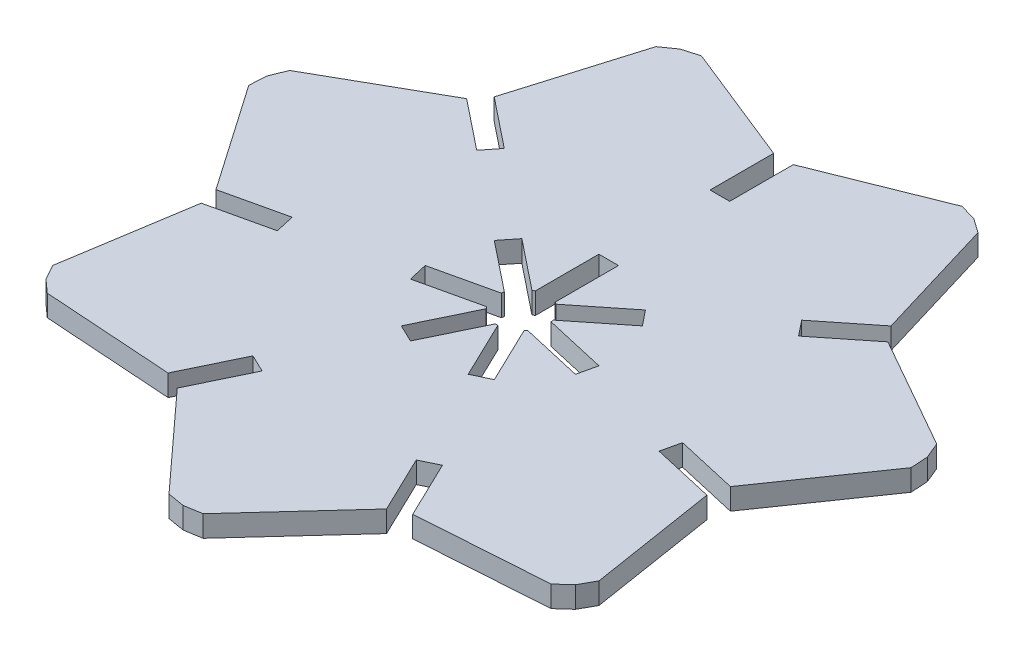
ISO-10303-21;
HEADER;
FILE_DESCRIPTION(('STEP AP214'),'2;1');
FILE_NAME('part.step','',(''),(''),'','','');
FILE_SCHEMA(('AUTOMOTIVE_DESIGN { 1 0 10303 214 1 1 1 1 }'));
ENDSEC;
DATA;
#1=APPLICATION_CONTEXT('core data for automotive mechanical design processes');
#2=APPLICATION_PROTOCOL_DEFINITION('international standard','automotive_design',2000,#1);
#3=PRODUCT_CONTEXT('',#1,'mechanical');
#4=PRODUCT('Part','Part','',(#3));
#5=PRODUCT_RELATED_PRODUCT_CATEGORY('part','',(#4));
#6=PRODUCT_DEFINITION_FORMATION('','',#4);
#7=PRODUCT_DEFINITION_CONTEXT('part definition',#1,'design');
#8=PRODUCT_DEFINITION('design','',#6,#7);
#9=PRODUCT_DEFINITION_SHAPE('','',#8);
#10=(LENGTH_UNIT() NAMED_UNIT(*) SI_UNIT(.MILLI.,.METRE.));
#11=(NAMED_UNIT(*) PLANE_ANGLE_UNIT() SI_UNIT($,.RADIAN.));
#12=(NAMED_UNIT(*) SI_UNIT($,.STERADIAN.) SOLID_ANGLE_UNIT());
#13=UNCERTAINTY_MEASURE_WITH_UNIT(LENGTH_MEASURE(1.E-05),#10,'distance_accuracy_value','');
#14=(GEOMETRIC_REPRESENTATION_CONTEXT(3) GLOBAL_UNCERTAINTY_ASSIGNED_CONTEXT((#13)) GLOBAL_UNIT_ASSIGNED_CONTEXT((#10,
#11,#12)) REPRESENTATION_CONTEXT('',''));
#15=CARTESIAN_POINT('',(0.,0.,0.));
#16=DIRECTION('',(0.,0.,1.));
#17=DIRECTION('',(1.,0.,0.));
#18=AXIS2_PLACEMENT_3D('',#15,#16,#17);
#19=CARTESIAN_POINT('',(0.,1.25,0.));
#20=DIRECTION('',(0.,-1.,0.));
#21=DIRECTION('',(0.,0.,-1.));
#22=AXIS2_PLACEMENT_3D('',#19,#20,#21);
#23=CYLINDRICAL_SURFACE('',#22,2.9625);
#24=DIRECTION('',(0.,-1.,0.));
#25=VECTOR('',#24,1.);
#26=CARTESIAN_POINT('',(-0.148468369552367,1.25,2.95877734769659));
#27=LINE('',#26,#25);
#28=CARTESIAN_POINT('',(-0.148468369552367,1.25,2.95877734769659));
#29=VERTEX_POINT('',#28);
#30=CARTESIAN_POINT('',(-0.148468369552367,-1.25000625,2.95877734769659));
#31=VERTEX_POINT('',#30);
#32=EDGE_CURVE('E702',#29,#31,#27,.T.);
#33=ORIENTED_EDGE('',*,*,#32,.F.);
#34=CARTESIAN_POINT('',(0.,1.25,0.));
#35=DIRECTION('',(0.,1.,0.));
#36=DIRECTION('',(0.,0.,1.));
#37=AXIS2_PLACEMENT_3D('',#34,#35,#36);
#38=CIRCLE('',#37,2.9625);
#39=CARTESIAN_POINT('',(0.148468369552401,1.25,2.95877734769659));
#40=VERTEX_POINT('',#39);
#41=EDGE_CURVE('E1033',#29,#40,#38,.T.);
#42=ORIENTED_EDGE('',*,*,#41,.T.);
#43=DIRECTION('',(0.,-1.,0.));
#44=VECTOR('',#43,1.);
#45=CARTESIAN_POINT('',(0.148468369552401,1.25,2.95877734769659));
#46=LINE('',#45,#44);
#47=CARTESIAN_POINT('',(0.148468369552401,-1.25000625,2.95877734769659));
#48=VERTEX_POINT('',#47);
#49=EDGE_CURVE('E691',#48,#40,#46,.F.);
#50=ORIENTED_EDGE('',*,*,#49,.F.);
#51=CARTESIAN_POINT('',(0.,-1.25,0.));
#52=DIRECTION('',(0.,1.,0.));
#53=DIRECTION('',(0.,0.,1.));
#54=AXIS2_PLACEMENT_3D('',#51,#52,#53);
#55=CIRCLE('',#54,2.9625);
#56=EDGE_CURVE('E645',#31,#48,#55,.T.);
#57=ORIENTED_EDGE('',*,*,#56,.F.);
#58=EDGE_LOOP('',(#33,#42,#50,#57));
#59=FACE_BOUND('',#58,.T.);
#60=ADVANCED_FACE('F37',(#59),#23,.F.);
#61=DIRECTION('',(0.,-1.,0.));
#62=VECTOR('',#61,1.);
#63=CARTESIAN_POINT('',(2.22069676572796,1.25,1.96084474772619));
#64=LINE('',#63,#62);
#65=CARTESIAN_POINT('',(2.22069676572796,1.25,1.96084474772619));
#66=VERTEX_POINT('',#65);
#67=CARTESIAN_POINT('',(2.22069676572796,-1.25000625,1.96084474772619));
#68=VERTEX_POINT('',#67);
#69=EDGE_CURVE('E694',#66,#68,#64,.T.);
#70=ORIENTED_EDGE('',*,*,#69,.F.);
#71=CARTESIAN_POINT('',(2.40583379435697,1.25,1.72869025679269));
#72=VERTEX_POINT('',#71);
#73=EDGE_CURVE('E1030',#66,#72,#38,.T.);
#74=ORIENTED_EDGE('',*,*,#73,.T.);
#75=DIRECTION('',(0.,-1.,0.));
#76=VECTOR('',#75,1.);
#77=CARTESIAN_POINT('',(2.40583379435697,1.25,1.72869025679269));
#78=LINE('',#77,#76);
#79=CARTESIAN_POINT('',(2.40583379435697,-1.25000625,1.72869025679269));
#80=VERTEX_POINT('',#79);
#81=EDGE_CURVE('E635',#80,#72,#78,.F.);
#82=ORIENTED_EDGE('',*,*,#81,.F.);
#83=EDGE_CURVE('E641',#68,#80,#55,.T.);
#84=ORIENTED_EDGE('',*,*,#83,.F.);
#85=EDGE_LOOP('',(#70,#74,#82,#84));
#86=FACE_BOUND('',#85,.T.);
#87=ADVANCED_FACE('F1313',(#86),#23,.F.);
#88=DIRECTION('',(0.,-1.,0.));
#89=VECTOR('',#88,1.);
#90=CARTESIAN_POINT('',(-2.85155730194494,1.25,-0.803135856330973));
#91=LINE('',#90,#89);
#92=CARTESIAN_POINT('',(-2.85155730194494,1.25,-0.803135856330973));
#93=VERTEX_POINT('',#92);
#94=CARTESIAN_POINT('',(-2.85155730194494,-1.25000625,-0.803135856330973));
#95=VERTEX_POINT('',#94);
#96=EDGE_CURVE('E683',#93,#95,#91,.T.);
#97=ORIENTED_EDGE('',*,*,#96,.F.);
#98=CARTESIAN_POINT('',(-2.91763194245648,1.25,-0.513643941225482));
#99=VERTEX_POINT('',#98);
#100=EDGE_CURVE('E1151',#93,#99,#38,.T.);
#101=ORIENTED_EDGE('',*,*,#100,.T.);
#102=DIRECTION('',(0.,-1.,0.));
#103=VECTOR('',#102,1.);
#104=CARTESIAN_POINT('',(-2.91763194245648,1.25,-0.513643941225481));
#105=LINE('',#104,#103);
#106=CARTESIAN_POINT('',(-2.91763194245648,-1.25000625,-0.513643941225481));
#107=VERTEX_POINT('',#106);
#108=EDGE_CURVE('E1012',#107,#99,#105,.F.);
#109=ORIENTED_EDGE('',*,*,#108,.F.);
#110=EDGE_CURVE('E672',#95,#107,#55,.T.);
#111=ORIENTED_EDGE('',*,*,#110,.F.);
#112=EDGE_LOOP('',(#97,#101,#109,#111));
#113=FACE_BOUND('',#112,.T.);
#114=ADVANCED_FACE('F1319',(#113),#23,.F.);
#115=DIRECTION('',(0.,-1.,0.));
#116=VECTOR('',#115,1.);
#117=CARTESIAN_POINT('',(-2.22069676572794,1.25,1.96084474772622));
#118=LINE('',#117,#116);
#119=CARTESIAN_POINT('',(-2.22069676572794,-1.25000625,1.96084474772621));
#120=VERTEX_POINT('',#119);
#121=CARTESIAN_POINT('',(-2.22069676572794,1.25,1.96084474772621));
#122=VERTEX_POINT('',#121);
#123=EDGE_CURVE('E699',#120,#122,#118,.F.);
#124=ORIENTED_EDGE('',*,*,#123,.F.);
#125=CARTESIAN_POINT('',(-2.40583379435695,-1.25000625,1.72869025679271));
#126=VERTEX_POINT('',#125);
#127=EDGE_CURVE('E676',#126,#120,#55,.T.);
#128=ORIENTED_EDGE('',*,*,#127,.F.);
#129=DIRECTION('',(0.,-1.,0.));
#130=VECTOR('',#129,1.);
#131=CARTESIAN_POINT('',(-2.40583379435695,1.25,1.72869025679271));
#132=LINE('',#131,#130);
#133=CARTESIAN_POINT('',(-2.40583379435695,1.25,1.72869025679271));
#134=VERTEX_POINT('',#133);
#135=EDGE_CURVE('E684',#134,#126,#132,.T.);
#136=ORIENTED_EDGE('',*,*,#135,.F.);
#137=EDGE_CURVE('E1159',#134,#122,#38,.T.);
#138=ORIENTED_EDGE('',*,*,#137,.T.);
#139=EDGE_LOOP('',(#124,#128,#136,#138));
#140=FACE_BOUND('',#139,.T.);
#141=ADVANCED_FACE('F1336',(#140),#23,.F.);
#142=DIRECTION('',(0.,-1.,0.));
#143=VECTOR('',#142,1.);
#144=CARTESIAN_POINT('',(1.41753075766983,1.25,-2.60134826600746));
#145=LINE('',#144,#143);
#146=CARTESIAN_POINT('',(1.41753075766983,1.25,-2.60134826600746));
#147=VERTEX_POINT('',#146);
#148=CARTESIAN_POINT('',(1.41753075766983,-1.25000625,-2.60134826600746));
#149=VERTEX_POINT('',#148);
#150=EDGE_CURVE('E1011',#147,#149,#145,.T.);
#151=ORIENTED_EDGE('',*,*,#150,.F.);
#152=CARTESIAN_POINT('',(1.15,1.25,-2.73018428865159));
#153=VERTEX_POINT('',#152);
#154=EDGE_CURVE('E689',#147,#153,#38,.T.);
#155=ORIENTED_EDGE('',*,*,#154,.T.);
#156=DIRECTION('',(0.,1.,0.));
#157=VECTOR('',#156,1.);
#158=CARTESIAN_POINT('',(1.15,-1.25,-2.73018428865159));
#159=LINE('',#158,#157);
#160=CARTESIAN_POINT('',(1.15,-1.25,-2.73018428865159));
#161=VERTEX_POINT('',#160);
#162=EDGE_CURVE('E955',#161,#153,#159,.T.);
#163=ORIENTED_EDGE('',*,*,#162,.F.);
#164=EDGE_CURVE('E668',#149,#161,#55,.T.);
#165=ORIENTED_EDGE('',*,*,#164,.F.);
#166=EDGE_LOOP('',(#151,#155,#163,#165));
#167=FACE_BOUND('',#166,.T.);
#168=ADVANCED_FACE('F1228',(#167),#23,.F.);
#169=DIRECTION('',(0.,-1.,0.));
#170=VECTOR('',#169,1.);
#171=CARTESIAN_POINT('',(2.85155730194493,1.25,-0.803135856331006));
#172=LINE('',#171,#170);
#173=CARTESIAN_POINT('',(2.85155730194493,-1.25000625,-0.803135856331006));
#174=VERTEX_POINT('',#173);
#175=CARTESIAN_POINT('',(2.85155730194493,1.25,-0.803135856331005));
#176=VERTEX_POINT('',#175);
#177=EDGE_CURVE('E1008',#174,#176,#172,.F.);
#178=ORIENTED_EDGE('',*,*,#177,.F.);
#179=CARTESIAN_POINT('',(2.91763194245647,-1.25000625,-0.513643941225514));
#180=VERTEX_POINT('',#179);
#181=EDGE_CURVE('E646',#180,#174,#55,.T.);
#182=ORIENTED_EDGE('',*,*,#181,.F.);
#183=DIRECTION('',(0.,-1.,0.));
#184=VECTOR('',#183,1.);
#185=CARTESIAN_POINT('',(2.91763194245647,1.25,-0.513643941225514));
#186=LINE('',#185,#184);
#187=CARTESIAN_POINT('',(2.91763194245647,1.25,-0.513643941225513));
#188=VERTEX_POINT('',#187);
#189=EDGE_CURVE('E637',#188,#180,#186,.T.);
#190=ORIENTED_EDGE('',*,*,#189,.F.);
#191=EDGE_CURVE('E1009',#188,#176,#38,.T.);
#192=ORIENTED_EDGE('',*,*,#191,.T.);
#193=EDGE_LOOP('',(#178,#182,#190,#192));
#194=FACE_BOUND('',#193,.T.);
#195=ADVANCED_FACE('F1005',(#194),#23,.F.);
#196=CARTESIAN_POINT('',(0.,1.25,0.));
#197=DIRECTION('',(0.,1.,0.));
#198=DIRECTION('',(0.,0.,1.));
#199=AXIS2_PLACEMENT_3D('',#196,#197,#198);
#200=PLANE('',#199);
#201=DIRECTION('',(0.433883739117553,0.,-0.900968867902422));
#202=VECTOR('',#201,1.);
#203=CARTESIAN_POINT('',(1.03611419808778,1.25,0.498966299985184));
#204=LINE('',#203,#202);
#205=CARTESIAN_POINT('',(-3.38178480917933,1.25,9.67282811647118));
#206=VERTEX_POINT('',#205);
#207=EDGE_CURVE('E845',#206,#29,#204,.T.);
#208=ORIENTED_EDGE('',*,*,#207,.F.);
#209=DIRECTION('',(0.900968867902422,0.,0.433883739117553));
#210=VECTOR('',#209,1.);
#211=CARTESIAN_POINT('',(-4.41789900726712,1.25,9.173861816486));
#212=LINE('',#211,#210);
#213=CARTESIAN_POINT('',(-5.4540132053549,1.25,8.67489551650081));
#214=VERTEX_POINT('',#213);
#215=EDGE_CURVE('E575',#214,#206,#212,.T.);
#216=ORIENTED_EDGE('',*,*,#215,.F.);
#217=DIRECTION('',(-0.433883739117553,0.,0.900968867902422));
#218=VECTOR('',#217,1.);
#219=CARTESIAN_POINT('',(-1.03611419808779,1.25,-0.498966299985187));
#220=LINE('',#219,#218);
#221=EDGE_CURVE('E628',#122,#214,#220,.T.);
#222=ORIENTED_EDGE('',*,*,#221,.F.);
#223=ORIENTED_EDGE('',*,*,#137,.F.);
#224=DIRECTION('',(0.974927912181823,0.,-0.222520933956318));
#225=VECTOR('',#224,1.);
#226=CARTESIAN_POINT('',(0.255899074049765,1.25,1.12116709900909));
#227=LINE('',#226,#225);
#228=CARTESIAN_POINT('',(-9.67102988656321,1.25,3.38692385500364));
#229=VERTEX_POINT('',#228);
#230=EDGE_CURVE('E601',#229,#134,#227,.T.);
#231=ORIENTED_EDGE('',*,*,#230,.F.);
#232=DIRECTION('',(0.222520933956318,0.,0.974927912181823));
#233=VECTOR('',#232,1.);
#234=CARTESIAN_POINT('',(-9.92692896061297,1.25,2.26575675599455));
#235=LINE('',#234,#233);
#236=CARTESIAN_POINT('',(-10.1828280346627,1.25,1.14458965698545));
#237=VERTEX_POINT('',#236);
#238=EDGE_CURVE('E925',#237,#229,#235,.T.);
#239=ORIENTED_EDGE('',*,*,#238,.F.);
#240=DIRECTION('',(-0.974927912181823,0.,0.222520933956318));
#241=VECTOR('',#240,1.);
#242=CARTESIAN_POINT('',(-0.255899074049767,1.25,-1.1211670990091));
#243=LINE('',#242,#241);
#244=EDGE_CURVE('E596',#99,#237,#243,.T.);
#245=ORIENTED_EDGE('',*,*,#244,.F.);
#246=ORIENTED_EDGE('',*,*,#100,.F.);
#247=DIRECTION('',(0.781831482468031,0.,0.623489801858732));
#248=VECTOR('',#247,1.);
#249=CARTESIAN_POINT('',(-0.71701327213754,1.25,0.899106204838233));
#250=LINE('',#249,#248);
#251=CARTESIAN_POINT('',(-8.677792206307,1.25,-5.44940314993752));
#252=VERTEX_POINT('',#251);
#253=EDGE_CURVE('E620',#252,#93,#250,.T.);
#254=ORIENTED_EDGE('',*,*,#253,.F.);
#255=DIRECTION('',(-0.623489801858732,0.,0.781831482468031));
#256=VECTOR('',#255,1.);
#257=CARTESIAN_POINT('',(-7.96077893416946,1.25,-6.34850935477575));
#258=LINE('',#257,#256);
#259=CARTESIAN_POINT('',(-7.24376566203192,1.25,-7.24761555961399));
#260=VERTEX_POINT('',#259);
#261=EDGE_CURVE('E927',#260,#252,#258,.T.);
#262=ORIENTED_EDGE('',*,*,#261,.F.);
#263=DIRECTION('',(-0.781831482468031,0.,-0.623489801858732));
#264=VECTOR('',#263,1.);
#265=CARTESIAN_POINT('',(0.717013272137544,1.25,-0.899106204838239));
#266=LINE('',#265,#264);
#267=CARTESIAN_POINT('',(-1.41753075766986,1.25,-2.60134826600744));
#268=VERTEX_POINT('',#267);
#269=EDGE_CURVE('E605',#268,#260,#266,.T.);
#270=ORIENTED_EDGE('',*,*,#269,.F.);
#271=CARTESIAN_POINT('',(-1.15,1.250006,-2.73018428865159));
#272=VERTEX_POINT('',#271);
#273=EDGE_CURVE('E1147',#272,#268,#38,.T.);
#274=ORIENTED_EDGE('',*,*,#273,.F.);
#275=DIRECTION('',(0.,0.,1.));
#276=VECTOR('',#275,1.);
#277=CARTESIAN_POINT('',(-1.15,1.25,0.));
#278=LINE('',#277,#276);
#279=CARTESIAN_POINT('',(-1.15,1.25,-10.1822184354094));
#280=VERTEX_POINT('',#279);
#281=EDGE_CURVE('E969',#280,#272,#278,.T.);
#282=ORIENTED_EDGE('',*,*,#281,.F.);
#283=DIRECTION('',(-1.,0.,0.));
#284=VECTOR('',#283,1.);
#285=CARTESIAN_POINT('',(0.,1.25,-10.1822184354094));
#286=LINE('',#285,#284);
#287=CARTESIAN_POINT('',(1.15,1.25,-10.1822184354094));
#288=VERTEX_POINT('',#287);
#289=EDGE_CURVE('E987',#288,#280,#286,.T.);
#290=ORIENTED_EDGE('',*,*,#289,.F.);
#291=DIRECTION('',(0.,0.,-1.));
#292=VECTOR('',#291,1.);
#293=CARTESIAN_POINT('',(1.15,1.25,0.));
#294=LINE('',#293,#292);
#295=EDGE_CURVE('E967',#153,#288,#294,.T.);
#296=ORIENTED_EDGE('',*,*,#295,.F.);
#297=ORIENTED_EDGE('',*,*,#154,.F.);
#298=DIRECTION('',(-0.781831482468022,0.,0.623489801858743));
#299=VECTOR('',#298,1.);
#300=CARTESIAN_POINT('',(-0.717013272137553,1.25,-0.899106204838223));
#301=LINE('',#300,#299);
#302=CARTESIAN_POINT('',(7.24376566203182,1.25,-7.24761555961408));
#303=VERTEX_POINT('',#302);
#304=EDGE_CURVE('E597',#303,#147,#301,.T.);
#305=ORIENTED_EDGE('',*,*,#304,.F.);
#306=DIRECTION('',(-0.623489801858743,0.,-0.781831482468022));
#307=VECTOR('',#306,1.);
#308=CARTESIAN_POINT('',(7.96077893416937,1.25,-6.34850935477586));
#309=LINE('',#308,#307);
#310=CARTESIAN_POINT('',(8.67779220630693,1.25,-5.44940314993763));
#311=VERTEX_POINT('',#310);
#312=EDGE_CURVE('E923',#311,#303,#309,.T.);
#313=ORIENTED_EDGE('',*,*,#312,.F.);
#314=DIRECTION('',(0.781831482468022,0.,-0.623489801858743));
#315=VECTOR('',#314,1.);
#316=CARTESIAN_POINT('',(0.717013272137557,1.25,0.899106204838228));
#317=LINE('',#316,#315);
#318=EDGE_CURVE('E582',#176,#311,#317,.T.);
#319=ORIENTED_EDGE('',*,*,#318,.F.);
#320=ORIENTED_EDGE('',*,*,#191,.F.);
#321=DIRECTION('',(-0.974927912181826,0.,-0.222520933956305));
#322=VECTOR('',#321,1.);
#323=CARTESIAN_POINT('',(0.25589907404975,1.25,-1.1211670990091));
#324=LINE('',#323,#322);
#325=CARTESIAN_POINT('',(10.1828280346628,1.25,1.14458965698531));
#326=VERTEX_POINT('',#325);
#327=EDGE_CURVE('E580',#326,#188,#324,.T.);
#328=ORIENTED_EDGE('',*,*,#327,.F.);
#329=DIRECTION('',(0.222520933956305,0.,-0.974927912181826));
#330=VECTOR('',#329,1.);
#331=CARTESIAN_POINT('',(9.926928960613,1.25,2.26575675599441));
#332=LINE('',#331,#330);
#333=CARTESIAN_POINT('',(9.67102988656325,1.25,3.38692385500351));
#334=VERTEX_POINT('',#333);
#335=EDGE_CURVE('E921',#334,#326,#332,.T.);
#336=ORIENTED_EDGE('',*,*,#335,.F.);
#337=DIRECTION('',(0.974927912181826,0.,0.222520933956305));
#338=VECTOR('',#337,1.);
#339=CARTESIAN_POINT('',(-0.255899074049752,1.25,1.1211670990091));
#340=LINE('',#339,#338);
#341=EDGE_CURVE('E573',#72,#334,#340,.T.);
#342=ORIENTED_EDGE('',*,*,#341,.F.);
#343=ORIENTED_EDGE('',*,*,#73,.F.);
#344=DIRECTION('',(-0.433883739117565,0.,-0.900968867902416));
#345=VECTOR('',#344,1.);
#346=CARTESIAN_POINT('',(1.03611419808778,1.25,-0.498966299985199));
#347=LINE('',#346,#345);
#348=CARTESIAN_POINT('',(5.45401320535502,1.25,8.67489551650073));
#349=VERTEX_POINT('',#348);
#350=EDGE_CURVE('E624',#349,#66,#347,.T.);
#351=ORIENTED_EDGE('',*,*,#350,.F.);
#352=DIRECTION('',(0.900968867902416,0.,-0.433883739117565));
#353=VECTOR('',#352,1.);
#354=CARTESIAN_POINT('',(4.41789900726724,1.25,9.17386181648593));
#355=LINE('',#354,#353);
#356=CARTESIAN_POINT('',(3.38178480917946,1.25,9.67282811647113));
#357=VERTEX_POINT('',#356);
#358=EDGE_CURVE('E928',#357,#349,#355,.T.);
#359=ORIENTED_EDGE('',*,*,#358,.F.);
#360=DIRECTION('',(0.433883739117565,0.,0.900968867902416));
#361=VECTOR('',#360,1.);
#362=CARTESIAN_POINT('',(-1.03611419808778,1.25,0.498966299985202));
#363=LINE('',#362,#361);
#364=EDGE_CURVE('E619',#40,#357,#363,.T.);
#365=ORIENTED_EDGE('',*,*,#364,.F.);
#366=ORIENTED_EDGE('',*,*,#41,.F.);
#367=EDGE_LOOP('',(#208,#216,#222,#223,#231,#239,#245,#246,#254,#262,#270,#274,#282,#290,#296,
#297,#305,#313,#319,#320,#328,#336,#342,#343,#351,#359,#365,#366));
#368=FACE_BOUND('',#367,.T.);
#369=DIRECTION('',(0.959908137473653,0.,-0.280314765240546));
#370=VECTOR('',#369,1.);
#371=CARTESIAN_POINT('',(-10.9753215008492,1.25,-37.5838226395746));
#372=LINE('',#371,#370);
#373=CARTESIAN_POINT('',(-17.2210713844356,1.25,-35.7599232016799));
#374=VERTEX_POINT('',#373);
#375=CARTESIAN_POINT('',(-15.2740326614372,1.25,-36.3285022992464));
#376=VERTEX_POINT('',#375);
#377=EDGE_CURVE('E817',#374,#376,#372,.T.);
#378=ORIENTED_EDGE('',*,*,#377,.F.);
#379=DIRECTION('',(0.817651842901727,0.,-0.575713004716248));
#380=VECTOR('',#379,1.);
#381=CARTESIAN_POINT('',(-22.5412147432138,1.25,-32.0139820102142));
#382=LINE('',#381,#380);
#383=CARTESIAN_POINT('',(-18.8795632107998,1.25,-34.5921702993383));
#384=VERTEX_POINT('',#383);
#385=EDGE_CURVE('E974',#384,#374,#382,.T.);
#386=ORIENTED_EDGE('',*,*,#385,.F.);
#387=DIRECTION('',(0.28762508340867,0.,-0.957743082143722));
#388=VECTOR('',#387,1.);
#389=CARTESIAN_POINT('',(-26.8468286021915,1.25,-8.0625184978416));
#390=LINE('',#389,#388);
#391=CARTESIAN_POINT('',(-23.2565879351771,1.25,-20.0174152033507));
#392=VERTEX_POINT('',#391);
#393=EDGE_CURVE('E532',#392,#384,#390,.T.);
#394=ORIENTED_EDGE('',*,*,#393,.F.);
#395=DIRECTION('',(-0.781831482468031,0.,-0.623489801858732));
#396=VECTOR('',#395,1.);
#397=CARTESIAN_POINT('',(0.717013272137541,1.25,-0.899106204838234));
#398=LINE('',#397,#396);
#399=CARTESIAN_POINT('',(-17.430353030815,1.25,-15.3711479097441));
#400=VERTEX_POINT('',#399);
#401=EDGE_CURVE('E540',#400,#392,#398,.T.);
#402=ORIENTED_EDGE('',*,*,#401,.F.);
#403=DIRECTION('',(0.623489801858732,0.,-0.781831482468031));
#404=VECTOR('',#403,1.);
#405=CARTESIAN_POINT('',(-18.1473663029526,1.25,-14.4720417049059));
#406=LINE('',#405,#404);
#407=CARTESIAN_POINT('',(-18.8643795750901,1.25,-13.5729355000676));
#408=VERTEX_POINT('',#407);
#409=EDGE_CURVE('E918',#408,#400,#406,.T.);
#410=ORIENTED_EDGE('',*,*,#409,.F.);
#411=DIRECTION('',(0.781831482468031,0.,0.623489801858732));
#412=VECTOR('',#411,1.);
#413=CARTESIAN_POINT('',(-0.717013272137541,1.25,0.899106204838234));
#414=LINE('',#413,#412);
#415=CARTESIAN_POINT('',(-24.6906144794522,1.25,-18.2192027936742));
#416=VERTEX_POINT('',#415);
#417=EDGE_CURVE('E916',#416,#408,#414,.T.);
#418=ORIENTED_EDGE('',*,*,#417,.F.);
#419=DIRECTION('',(0.869727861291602,0.,-0.493531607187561));
#420=VECTOR('',#419,1.);
#421=CARTESIAN_POINT('',(-13.8343557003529,1.25,-24.379643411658));
#422=LINE('',#421,#420);
#423=CARTESIAN_POINT('',(-37.9259704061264,1.25,-10.7087311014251));
#424=VERTEX_POINT('',#423);
#425=EDGE_CURVE('E805',#424,#416,#422,.T.);
#426=ORIENTED_EDGE('',*,*,#425,.F.);
#427=DIRECTION('',(0.379334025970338,0.,-0.925259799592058));
#428=VECTOR('',#427,1.);
#429=CARTESIAN_POINT('',(-36.2272167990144,1.25,-14.8522782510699));
#430=LINE('',#429,#428);
#431=CARTESIAN_POINT('',(-38.6953961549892,1.25,-8.83197166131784));
#432=VERTEX_POINT('',#431);
#433=EDGE_CURVE('E911',#432,#424,#430,.T.);
#434=ORIENTED_EDGE('',*,*,#433,.F.);
#435=DIRECTION('',(0.0596870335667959,0.,-0.998217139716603));
#436=VECTOR('',#435,1.);
#437=CARTESIAN_POINT('',(-39.0837565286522,1.25,-2.33695996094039));
#438=LINE('',#437,#436);
#439=CARTESIAN_POINT('',(-38.8164629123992,1.25,-6.8072285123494));
#440=VERTEX_POINT('',#439);
#441=EDGE_CURVE('E913',#440,#432,#438,.T.);
#442=ORIENTED_EDGE('',*,*,#441,.F.);
#443=DIRECTION('',(-0.569462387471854,0.,-0.822017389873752));
#444=VECTOR('',#443,1.);
#445=CARTESIAN_POINT('',(-23.0422546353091,1.25,15.9627977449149));
#446=LINE('',#445,#444);
#447=CARTESIAN_POINT('',(-30.1504908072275,1.25,5.70207838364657));
#448=VERTEX_POINT('',#447);
#449=EDGE_CURVE('E909',#448,#440,#446,.T.);
#450=ORIENTED_EDGE('',*,*,#449,.F.);
#451=DIRECTION('',(-0.974927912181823,0.,0.222520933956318));
#452=VECTOR('',#451,1.);
#453=CARTESIAN_POINT('',(-0.255899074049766,1.25,-1.1211670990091));
#454=LINE('',#453,#452);
#455=CARTESIAN_POINT('',(-22.8852947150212,1.25,4.04384478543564));
#456=VERTEX_POINT('',#455);
#457=EDGE_CURVE('E907',#456,#448,#454,.T.);
#458=ORIENTED_EDGE('',*,*,#457,.F.);
#459=DIRECTION('',(-0.222520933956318,0.,-0.974927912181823));
#460=VECTOR('',#459,1.);
#461=CARTESIAN_POINT('',(-22.6293956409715,1.25,5.16501188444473));
#462=LINE('',#461,#460);
#463=CARTESIAN_POINT('',(-22.3734965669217,1.25,6.28617898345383));
#464=VERTEX_POINT('',#463);
#465=EDGE_CURVE('E905',#464,#456,#462,.T.);
#466=ORIENTED_EDGE('',*,*,#465,.F.);
#467=DIRECTION('',(0.974927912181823,0.,-0.222520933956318));
#468=VECTOR('',#467,1.);
#469=CARTESIAN_POINT('',(0.255899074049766,1.25,1.1211670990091));
#470=LINE('',#469,#468);
#471=CARTESIAN_POINT('',(-29.638692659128,1.25,7.94441258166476));
#472=VERTEX_POINT('',#471);
#473=EDGE_CURVE('E903',#472,#464,#470,.T.);
#474=ORIENTED_EDGE('',*,*,#473,.F.);
#475=DIRECTION('',(0.156407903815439,0.,-0.987692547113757));
#476=VECTOR('',#475,1.);
#477=CARTESIAN_POINT('',(-27.6863524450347,1.25,-4.38432421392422));
#478=LINE('',#477,#476);
#479=CARTESIAN_POINT('',(-32.0188788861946,1.25,22.9749330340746));
#480=VERTEX_POINT('',#479);
#481=EDGE_CURVE('E901',#480,#472,#478,.T.);
#482=ORIENTED_EDGE('',*,*,#481,.F.);
#483=DIRECTION('',(-0.486886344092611,0.,-0.873465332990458));
#484=VECTOR('',#483,1.);
#485=CARTESIAN_POINT('',(-34.1992789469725,1.25,19.0633345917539));
#486=LINE('',#485,#484);
#487=CARTESIAN_POINT('',(-31.0312983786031,1.25,24.7466346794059));
#488=VERTEX_POINT('',#487);
#489=EDGE_CURVE('E897',#488,#480,#486,.T.);
#490=ORIENTED_EDGE('',*,*,#489,.F.);
#491=DIRECTION('',(-0.743223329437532,0.,-0.669043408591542));
#492=VECTOR('',#491,1.);
#493=CARTESIAN_POINT('',(-26.1954324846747,1.25,29.0998406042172));
#494=LINE('',#493,#492);
#495=CARTESIAN_POINT('',(-29.5237743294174,1.25,26.1036951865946));
#496=VERTEX_POINT('',#495);
#497=EDGE_CURVE('E899',#496,#488,#494,.T.);
#498=ORIENTED_EDGE('',*,*,#497,.F.);
#499=DIRECTION('',(-0.997733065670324,0.,-0.0672958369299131));
#500=VECTOR('',#499,1.);
#501=CARTESIAN_POINT('',(-1.88639295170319,1.25,27.9678017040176));
#502=LINE('',#501,#500);
#503=CARTESIAN_POINT('',(-14.3404591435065,1.25,27.1277906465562));
#504=VERTEX_POINT('',#503);
#505=EDGE_CURVE('E895',#504,#496,#502,.T.);
#506=ORIENTED_EDGE('',*,*,#505,.F.);
#507=DIRECTION('',(-0.433883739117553,0.,0.900968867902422));
#508=VECTOR('',#507,1.);
#509=CARTESIAN_POINT('',(-1.03611419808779,1.25,-0.498966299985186));
#510=LINE('',#509,#508);
#511=CARTESIAN_POINT('',(-11.1071427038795,1.25,20.4137398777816));
#512=VERTEX_POINT('',#511);
#513=EDGE_CURVE('E893',#512,#504,#510,.T.);
#514=ORIENTED_EDGE('',*,*,#513,.F.);
#515=DIRECTION('',(-0.900968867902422,0.,-0.433883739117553));
#516=VECTOR('',#515,1.);
#517=CARTESIAN_POINT('',(-10.0710285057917,1.25,20.9127061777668));
#518=LINE('',#517,#516);
#519=CARTESIAN_POINT('',(-9.03491430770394,1.25,21.411672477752));
#520=VERTEX_POINT('',#519);
#521=EDGE_CURVE('E891',#520,#512,#518,.T.);
#522=ORIENTED_EDGE('',*,*,#521,.F.);
#523=DIRECTION('',(0.433883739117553,0.,-0.900968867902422));
#524=VECTOR('',#523,1.);
#525=CARTESIAN_POINT('',(1.03611419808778,1.25,0.498966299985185));
#526=LINE('',#525,#524);
#527=CARTESIAN_POINT('',(-12.2682307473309,1.25,28.1257232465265));
#528=VERTEX_POINT('',#527);
#529=EDGE_CURVE('E889',#528,#520,#526,.T.);
#530=ORIENTED_EDGE('',*,*,#529,.F.);
#531=DIRECTION('',(-0.674690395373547,0.,-0.738100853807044));
#532=VECTOR('',#531,1.);
#533=CARTESIAN_POINT('',(-20.6899610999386,1.25,18.9124805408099));
#534=LINE('',#533,#532);
#535=CARTESIAN_POINT('',(-2.00091849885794,1.25,39.3580039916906));
#536=VERTEX_POINT('',#535);
#537=EDGE_CURVE('E887',#536,#528,#534,.T.);
#538=ORIENTED_EDGE('',*,*,#537,.F.);
#539=DIRECTION('',(-0.986471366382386,0.,-0.163933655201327));
#540=VECTOR('',#539,1.);
#541=CARTESIAN_POINT('',(-6.41858650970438,1.25,38.6238676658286));
#542=LINE('',#541,#540);
#543=CARTESIAN_POINT('',(2.97938756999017E-13,1.25,39.6905203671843));
#544=VERTEX_POINT('',#543);
#545=EDGE_CURVE('E883',#544,#536,#542,.T.);
#546=ORIENTED_EDGE('',*,*,#545,.F.);
#547=DIRECTION('',(-0.986471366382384,0.,0.163933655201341));
#548=VECTOR('',#547,1.);
#549=CARTESIAN_POINT('',(6.41858650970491,1.25,38.6238676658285));
#550=LINE('',#549,#548);
#551=CARTESIAN_POINT('',(2.00091849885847,1.25,39.3580039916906));
#552=VERTEX_POINT('',#551);
#553=EDGE_CURVE('E885',#552,#544,#550,.T.);
#554=ORIENTED_EDGE('',*,*,#553,.F.);
#555=DIRECTION('',(-0.674690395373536,0.,0.738100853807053));
#556=VECTOR('',#555,1.);
#557=CARTESIAN_POINT('',(20.6899610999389,1.25,18.9124805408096));
#558=LINE('',#557,#556);
#559=CARTESIAN_POINT('',(12.2682307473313,1.25,28.1257232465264));
#560=VERTEX_POINT('',#559);
#561=EDGE_CURVE('E881',#560,#552,#558,.T.);
#562=ORIENTED_EDGE('',*,*,#561,.F.);
#563=DIRECTION('',(0.433883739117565,0.,0.900968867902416));
#564=VECTOR('',#563,1.);
#565=CARTESIAN_POINT('',(-1.03611419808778,1.25,0.4989662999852));
#566=LINE('',#565,#564);
#567=CARTESIAN_POINT('',(9.03491430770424,1.25,21.4116724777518));
#568=VERTEX_POINT('',#567);
#569=EDGE_CURVE('E879',#568,#560,#566,.T.);
#570=ORIENTED_EDGE('',*,*,#569,.F.);
#571=DIRECTION('',(-0.900968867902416,0.,0.433883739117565));
#572=VECTOR('',#571,1.);
#573=CARTESIAN_POINT('',(10.071028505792,1.25,20.9127061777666));
#574=LINE('',#573,#572);
#575=CARTESIAN_POINT('',(11.1071427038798,1.25,20.4137398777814));
#576=VERTEX_POINT('',#575);
#577=EDGE_CURVE('E877',#576,#568,#574,.T.);
#578=ORIENTED_EDGE('',*,*,#577,.F.);
#579=DIRECTION('',(-0.433883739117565,0.,-0.900968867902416));
#580=VECTOR('',#579,1.);
#581=CARTESIAN_POINT('',(1.03611419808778,1.25,-0.498966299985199));
#582=LINE('',#581,#580);
#583=CARTESIAN_POINT('',(14.3404591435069,1.25,27.127790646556));
#584=VERTEX_POINT('',#583);
#585=EDGE_CURVE('E875',#584,#576,#582,.T.);
#586=ORIENTED_EDGE('',*,*,#585,.F.);
#587=DIRECTION('',(-0.997733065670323,0.,0.067295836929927));
#588=VECTOR('',#587,1.);
#589=CARTESIAN_POINT('',(1.88639295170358,1.25,27.9678017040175));
#590=LINE('',#589,#588);
#591=CARTESIAN_POINT('',(29.5237743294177,1.25,26.1036951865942));
#592=VERTEX_POINT('',#591);
#593=EDGE_CURVE('E873',#592,#584,#590,.T.);
#594=ORIENTED_EDGE('',*,*,#593,.F.);
#595=DIRECTION('',(-0.743223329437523,0.,0.669043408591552));
#596=VECTOR('',#595,1.);
#597=CARTESIAN_POINT('',(26.1954324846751,1.25,29.0998406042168));
#598=LINE('',#597,#596);
#599=CARTESIAN_POINT('',(31.0312983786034,1.25,24.7466346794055));
#600=VERTEX_POINT('',#599);
#601=EDGE_CURVE('E869',#600,#592,#598,.T.);
#602=ORIENTED_EDGE('',*,*,#601,.F.);
#603=DIRECTION('',(-0.486886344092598,0.,0.873465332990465));
#604=VECTOR('',#603,1.);
#605=CARTESIAN_POINT('',(34.1992789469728,1.25,19.0633345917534));
#606=LINE('',#605,#604);
#607=CARTESIAN_POINT('',(32.0188788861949,1.25,22.9749330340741));
#608=VERTEX_POINT('',#607);
#609=EDGE_CURVE('E871',#608,#600,#606,.T.);
#610=ORIENTED_EDGE('',*,*,#609,.F.);
#611=DIRECTION('',(0.156407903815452,0.,0.987692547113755));
#612=VECTOR('',#611,1.);
#613=CARTESIAN_POINT('',(27.6863524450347,1.25,-4.38432421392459));
#614=LINE('',#613,#612);
#615=CARTESIAN_POINT('',(29.6386926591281,1.25,7.94441258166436));
#616=VERTEX_POINT('',#615);
#617=EDGE_CURVE('E867',#616,#608,#614,.T.);
#618=ORIENTED_EDGE('',*,*,#617,.F.);
#619=DIRECTION('',(0.974927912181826,0.,0.222520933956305));
#620=VECTOR('',#619,1.);
#621=CARTESIAN_POINT('',(-0.255899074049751,1.25,1.1211670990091));
#622=LINE('',#621,#620);
#623=CARTESIAN_POINT('',(22.3734965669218,1.25,6.28617898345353));
#624=VERTEX_POINT('',#623);
#625=EDGE_CURVE('E865',#624,#616,#622,.T.);
#626=ORIENTED_EDGE('',*,*,#625,.F.);
#627=DIRECTION('',(-0.222520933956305,0.,0.974927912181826));
#628=VECTOR('',#627,1.);
#629=CARTESIAN_POINT('',(22.6293956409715,1.25,5.16501188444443));
#630=LINE('',#629,#628);
#631=CARTESIAN_POINT('',(22.8852947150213,1.25,4.04384478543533));
#632=VERTEX_POINT('',#631);
#633=EDGE_CURVE('E863',#632,#624,#630,.T.);
#634=ORIENTED_EDGE('',*,*,#633,.F.);
#635=DIRECTION('',(-0.974927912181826,0.,-0.222520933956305));
#636=VECTOR('',#635,1.);
#637=CARTESIAN_POINT('',(0.255899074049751,1.25,-1.1211670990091));
#638=LINE('',#637,#636);
#639=CARTESIAN_POINT('',(30.1504908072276,1.25,5.70207838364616));
#640=VERTEX_POINT('',#639);
#641=EDGE_CURVE('E861',#640,#632,#638,.T.);
#642=ORIENTED_EDGE('',*,*,#641,.F.);
#643=DIRECTION('',(-0.569462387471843,0.,0.822017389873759));
#644=VECTOR('',#643,1.);
#645=CARTESIAN_POINT('',(23.0422546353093,1.25,15.9627977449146));
#646=LINE('',#645,#644);
#647=CARTESIAN_POINT('',(38.8164629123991,1.25,-6.80722851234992));
#648=VERTEX_POINT('',#647);
#649=EDGE_CURVE('E859',#648,#640,#646,.T.);
#650=ORIENTED_EDGE('',*,*,#649,.F.);
#651=DIRECTION('',(0.0596870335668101,0.,0.998217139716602));
#652=VECTOR('',#651,1.);
#653=CARTESIAN_POINT('',(39.0837565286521,1.25,-2.33695996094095));
#654=LINE('',#653,#652);
#655=CARTESIAN_POINT('',(38.695396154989,1.25,-8.8319716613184));
#656=VERTEX_POINT('',#655);
#657=EDGE_CURVE('E855',#656,#648,#654,.T.);
#658=ORIENTED_EDGE('',*,*,#657,.F.);
#659=DIRECTION('',(0.379334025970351,0.,0.925259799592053));
#660=VECTOR('',#659,1.);
#661=CARTESIAN_POINT('',(36.2272167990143,1.25,-14.8522782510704));
#662=LINE('',#661,#660);
#663=CARTESIAN_POINT('',(37.9259704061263,1.25,-10.7087311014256));
#664=VERTEX_POINT('',#663);
#665=EDGE_CURVE('E857',#664,#656,#662,.T.);
#666=ORIENTED_EDGE('',*,*,#665,.F.);
#667=DIRECTION('',(0.869727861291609,0.,0.493531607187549));
#668=VECTOR('',#667,1.);
#669=CARTESIAN_POINT('',(13.8343557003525,1.25,-24.3796434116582));
#670=LINE('',#669,#668);
#671=CARTESIAN_POINT('',(24.6906144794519,1.25,-18.2192027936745));
#672=VERTEX_POINT('',#671);
#673=EDGE_CURVE('E853',#672,#664,#670,.T.);
#674=ORIENTED_EDGE('',*,*,#673,.F.);
#675=DIRECTION('',(0.781831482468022,0.,-0.623489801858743));
#676=VECTOR('',#675,1.);
#677=CARTESIAN_POINT('',(0.717013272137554,1.25,0.899106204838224));
#678=LINE('',#677,#676);
#679=CARTESIAN_POINT('',(18.8643795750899,1.25,-13.5729355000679));
#680=VERTEX_POINT('',#679);
#681=EDGE_CURVE('E851',#680,#672,#678,.T.);
#682=ORIENTED_EDGE('',*,*,#681,.F.);
#683=DIRECTION('',(0.623489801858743,0.,0.781831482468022));
#684=VECTOR('',#683,1.);
#685=CARTESIAN_POINT('',(18.1473663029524,1.25,-14.4720417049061));
#686=LINE('',#685,#684);
#687=CARTESIAN_POINT('',(17.4303530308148,1.25,-15.3711479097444));
#688=VERTEX_POINT('',#687);
#689=EDGE_CURVE('E849',#688,#680,#686,.T.);
#690=ORIENTED_EDGE('',*,*,#689,.F.);
#691=DIRECTION('',(-0.781831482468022,0.,0.623489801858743));
#692=VECTOR('',#691,1.);
#693=CARTESIAN_POINT('',(-0.717013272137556,1.25,-0.899106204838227));
#694=LINE('',#693,#692);
#695=CARTESIAN_POINT('',(23.2565879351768,1.25,-20.017415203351));
#696=VERTEX_POINT('',#695);
#697=EDGE_CURVE('E847',#696,#688,#694,.T.);
#698=ORIENTED_EDGE('',*,*,#697,.F.);
#699=DIRECTION('',(0.287625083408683,0.,0.957743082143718));
#700=VECTOR('',#699,1.);
#701=CARTESIAN_POINT('',(26.8468286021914,1.25,-8.06251849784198));
#702=LINE('',#701,#700);
#703=CARTESIAN_POINT('',(18.8795632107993,1.25,-34.5921702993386));
#704=VERTEX_POINT('',#703);
#705=EDGE_CURVE('E574',#704,#696,#702,.T.);
#706=ORIENTED_EDGE('',*,*,#705,.F.);
#707=DIRECTION('',(0.817651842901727,0.,0.575713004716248));
#708=VECTOR('',#707,1.);
#709=CARTESIAN_POINT('',(22.5412147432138,1.25,-32.0139820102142));
#710=LINE('',#709,#708);
#711=CARTESIAN_POINT('',(17.2210713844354,1.25,-35.7599232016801));
#712=VERTEX_POINT('',#711);
#713=EDGE_CURVE('E984',#712,#704,#710,.T.);
#714=ORIENTED_EDGE('',*,*,#713,.F.);
#715=DIRECTION('',(0.959908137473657,0.,0.280314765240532));
#716=VECTOR('',#715,1.);
#717=CARTESIAN_POINT('',(10.9753215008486,1.25,-37.5838226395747));
#718=LINE('',#717,#716);
#719=CARTESIAN_POINT('',(15.2740326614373,1.25,-36.3285022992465));
#720=VERTEX_POINT('',#719);
#721=EDGE_CURVE('E825',#720,#712,#718,.T.);
#722=ORIENTED_EDGE('',*,*,#721,.F.);
#723=DIRECTION('',(0.928125,0.,-0.372268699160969));
#724=VECTOR('',#723,1.);
#725=CARTESIAN_POINT('',(-10.4351930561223,1.25,-26.0165938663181));
#726=LINE('',#725,#724);
#727=CARTESIAN_POINT('',(1.15,1.25,-30.6633868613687));
#728=VERTEX_POINT('',#727);
#729=EDGE_CURVE('E981',#728,#720,#726,.T.);
#730=ORIENTED_EDGE('',*,*,#729,.F.);
#731=DIRECTION('',(0.,0.,-1.));
#732=VECTOR('',#731,1.);
#733=CARTESIAN_POINT('',(1.15,1.25,0.));
#734=LINE('',#733,#732);
#735=CARTESIAN_POINT('',(1.15,1.25,-23.2113527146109));
#736=VERTEX_POINT('',#735);
#737=EDGE_CURVE('E651',#736,#728,#734,.T.);
#738=ORIENTED_EDGE('',*,*,#737,.F.);
#739=DIRECTION('',(1.,0.,0.));
#740=VECTOR('',#739,1.);
#741=CARTESIAN_POINT('',(0.,1.25,-23.2113527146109));
#742=LINE('',#741,#740);
#743=CARTESIAN_POINT('',(-1.15,1.25,-23.2113527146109));
#744=VERTEX_POINT('',#743);
#745=EDGE_CURVE('E990',#744,#736,#742,.T.);
#746=ORIENTED_EDGE('',*,*,#745,.F.);
#747=DIRECTION('',(0.,0.,1.));
#748=VECTOR('',#747,1.);
#749=CARTESIAN_POINT('',(-1.15,1.25,0.));
#750=LINE('',#749,#748);
#751=CARTESIAN_POINT('',(-1.15,1.25,-30.6633868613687));
#752=VERTEX_POINT('',#751);
#753=EDGE_CURVE('E989',#752,#744,#750,.T.);
#754=ORIENTED_EDGE('',*,*,#753,.F.);
#755=DIRECTION('',(0.928125,0.,0.372268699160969));
#756=VECTOR('',#755,1.);
#757=CARTESIAN_POINT('',(10.4351930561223,1.25,-26.0165938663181));
#758=LINE('',#757,#756);
#759=EDGE_CURVE('E979',#376,#752,#758,.T.);
#760=ORIENTED_EDGE('',*,*,#759,.F.);
#761=EDGE_LOOP('',(#378,#386,#394,#402,#410,#418,#426,#434,#442,#450,#458,#466,#474,#482,#490,
#498,#506,#514,#522,#530,#538,#546,#554,#562,#570,#578,#586,#594,#602,#610,#618,#626,#634,#642,
#650,#658,#666,#674,#682,#690,#698,#706,#714,#722,#730,#738,#746,#754,#760));
#762=FACE_BOUND('',#761,.T.);
#763=ADVANCED_FACE('F1026',(#368,#762),#200,.T.);
#764=CARTESIAN_POINT('',(0.,-1.25,0.));
#765=DIRECTION('',(0.,1.,0.));
#766=DIRECTION('',(0.,0.,1.));
#767=AXIS2_PLACEMENT_3D('',#764,#765,#766);
#768=PLANE('',#767);
#769=DIRECTION('',(0.817651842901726,0.,-0.575713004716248));
#770=VECTOR('',#769,1.);
#771=CARTESIAN_POINT('',(-16.,-1.25,-36.6196860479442));
#772=LINE('',#771,#770);
#773=CARTESIAN_POINT('',(-18.8795632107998,-1.25,-34.5921702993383));
#774=VERTEX_POINT('',#773);
#775=CARTESIAN_POINT('',(-17.2210713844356,-1.25,-35.7599232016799));
#776=VERTEX_POINT('',#775);
#777=EDGE_CURVE('E966',#774,#776,#772,.T.);
#778=ORIENTED_EDGE('',*,*,#777,.T.);
#779=DIRECTION('',(0.959908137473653,0.,-0.280314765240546));
#780=VECTOR('',#779,1.);
#781=CARTESIAN_POINT('',(-10.9753215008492,-1.25,-37.5838226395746));
#782=LINE('',#781,#780);
#783=CARTESIAN_POINT('',(-15.2740326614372,-1.25,-36.3285022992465));
#784=VERTEX_POINT('',#783);
#785=EDGE_CURVE('E814',#776,#784,#782,.T.);
#786=ORIENTED_EDGE('',*,*,#785,.T.);
#787=DIRECTION('',(0.928125,0.,0.372268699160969));
#788=VECTOR('',#787,1.);
#789=CARTESIAN_POINT('',(-16.,-1.25,-36.6196860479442));
#790=LINE('',#789,#788);
#791=CARTESIAN_POINT('',(-1.15,-1.25,-30.6633868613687));
#792=VERTEX_POINT('',#791);
#793=EDGE_CURVE('E1256',#784,#792,#790,.T.);
#794=ORIENTED_EDGE('',*,*,#793,.T.);
#795=DIRECTION('',(0.,0.,1.));
#796=VECTOR('',#795,1.);
#797=CARTESIAN_POINT('',(-1.15,-1.25,-30.6633868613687));
#798=LINE('',#797,#796);
#799=CARTESIAN_POINT('',(-1.15,-1.25,-23.2113527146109));
#800=VERTEX_POINT('',#799);
#801=EDGE_CURVE('E1254',#792,#800,#798,.T.);
#802=ORIENTED_EDGE('',*,*,#801,.T.);
#803=DIRECTION('',(1.,0.,0.));
#804=VECTOR('',#803,1.);
#805=CARTESIAN_POINT('',(-1.15,-1.25,-23.2113527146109));
#806=LINE('',#805,#804);
#807=CARTESIAN_POINT('',(1.15,-1.25,-23.2113527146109));
#808=VERTEX_POINT('',#807);
#809=EDGE_CURVE('E1251',#800,#808,#806,.T.);
#810=ORIENTED_EDGE('',*,*,#809,.T.);
#811=DIRECTION('',(0.,0.,-1.));
#812=VECTOR('',#811,1.);
#813=CARTESIAN_POINT('',(1.15,-1.25,-23.2113527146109));
#814=LINE('',#813,#812);
#815=CARTESIAN_POINT('',(1.15,-1.25,-30.6633868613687));
#816=VERTEX_POINT('',#815);
#817=EDGE_CURVE('E1248',#808,#816,#814,.T.);
#818=ORIENTED_EDGE('',*,*,#817,.T.);
#819=DIRECTION('',(0.928125,0.,-0.372268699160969));
#820=VECTOR('',#819,1.);
#821=CARTESIAN_POINT('',(1.15,-1.25,-30.6633868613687));
#822=LINE('',#821,#820);
#823=CARTESIAN_POINT('',(15.2740326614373,-1.25,-36.3285022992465));
#824=VERTEX_POINT('',#823);
#825=EDGE_CURVE('E1245',#816,#824,#822,.T.);
#826=ORIENTED_EDGE('',*,*,#825,.T.);
#827=DIRECTION('',(0.959908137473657,0.,0.280314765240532));
#828=VECTOR('',#827,1.);
#829=CARTESIAN_POINT('',(10.9753215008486,-1.25,-37.5838226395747));
#830=LINE('',#829,#828);
#831=CARTESIAN_POINT('',(17.2210713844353,-1.25,-35.7599232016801));
#832=VERTEX_POINT('',#831);
#833=EDGE_CURVE('E822',#824,#832,#830,.T.);
#834=ORIENTED_EDGE('',*,*,#833,.T.);
#835=DIRECTION('',(0.817651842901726,0.,0.575713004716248));
#836=VECTOR('',#835,1.);
#837=CARTESIAN_POINT('',(16.,-1.25,-36.6196860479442));
#838=LINE('',#837,#836);
#839=CARTESIAN_POINT('',(18.8795632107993,-1.25,-34.5921702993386));
#840=VERTEX_POINT('',#839);
#841=EDGE_CURVE('E1238',#832,#840,#838,.T.);
#842=ORIENTED_EDGE('',*,*,#841,.T.);
#843=DIRECTION('',(0.287625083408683,0.,0.957743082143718));
#844=VECTOR('',#843,1.);
#845=CARTESIAN_POINT('',(26.8468286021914,-1.25,-8.06251849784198));
#846=LINE('',#845,#844);
#847=CARTESIAN_POINT('',(23.2565879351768,-1.25,-20.017415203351));
#848=VERTEX_POINT('',#847);
#849=EDGE_CURVE('E830',#840,#848,#846,.T.);
#850=ORIENTED_EDGE('',*,*,#849,.T.);
#851=DIRECTION('',(-0.781831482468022,0.,0.623489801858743));
#852=VECTOR('',#851,1.);
#853=CARTESIAN_POINT('',(-0.717013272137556,-1.25,-0.899106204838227));
#854=LINE('',#853,#852);
#855=CARTESIAN_POINT('',(17.4303530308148,-1.25,-15.3711479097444));
#856=VERTEX_POINT('',#855);
#857=EDGE_CURVE('E710',#848,#856,#854,.T.);
#858=ORIENTED_EDGE('',*,*,#857,.T.);
#859=DIRECTION('',(0.623489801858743,0.,0.781831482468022));
#860=VECTOR('',#859,1.);
#861=CARTESIAN_POINT('',(18.1473663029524,-1.25,-14.4720417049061));
#862=LINE('',#861,#860);
#863=CARTESIAN_POINT('',(18.8643795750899,-1.25,-13.5729355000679));
#864=VERTEX_POINT('',#863);
#865=EDGE_CURVE('E1040',#856,#864,#862,.T.);
#866=ORIENTED_EDGE('',*,*,#865,.T.);
#867=DIRECTION('',(0.781831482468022,0.,-0.623489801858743));
#868=VECTOR('',#867,1.);
#869=CARTESIAN_POINT('',(0.717013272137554,-1.25,0.899106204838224));
#870=LINE('',#869,#868);
#871=CARTESIAN_POINT('',(24.6906144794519,-1.25,-18.2192027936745));
#872=VERTEX_POINT('',#871);
#873=EDGE_CURVE('E1043',#864,#872,#870,.T.);
#874=ORIENTED_EDGE('',*,*,#873,.T.);
#875=DIRECTION('',(0.869727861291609,0.,0.493531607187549));
#876=VECTOR('',#875,1.);
#877=CARTESIAN_POINT('',(13.8343557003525,-1.25,-24.3796434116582));
#878=LINE('',#877,#876);
#879=CARTESIAN_POINT('',(37.9259704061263,-1.25,-10.7087311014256));
#880=VERTEX_POINT('',#879);
#881=EDGE_CURVE('E1045',#872,#880,#878,.T.);
#882=ORIENTED_EDGE('',*,*,#881,.T.);
#883=DIRECTION('',(0.379334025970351,0.,0.925259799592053));
#884=VECTOR('',#883,1.);
#885=CARTESIAN_POINT('',(36.2272167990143,-1.25,-14.8522782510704));
#886=LINE('',#885,#884);
#887=CARTESIAN_POINT('',(38.695396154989,-1.2500025,-8.8319716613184));
#888=VERTEX_POINT('',#887);
#889=EDGE_CURVE('E718',#880,#888,#886,.T.);
#890=ORIENTED_EDGE('',*,*,#889,.T.);
#891=DIRECTION('',(0.0596870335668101,0.,0.998217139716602));
#892=VECTOR('',#891,1.);
#893=CARTESIAN_POINT('',(39.0837565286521,-1.25,-2.33695996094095));
#894=LINE('',#893,#892);
#895=CARTESIAN_POINT('',(38.8164629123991,-1.25,-6.80722851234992));
#896=VERTEX_POINT('',#895);
#897=EDGE_CURVE('E713',#888,#896,#894,.T.);
#898=ORIENTED_EDGE('',*,*,#897,.T.);
#899=DIRECTION('',(-0.569462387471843,0.,0.822017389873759));
#900=VECTOR('',#899,1.);
#901=CARTESIAN_POINT('',(23.0422546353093,-1.25,15.9627977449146));
#902=LINE('',#901,#900);
#903=CARTESIAN_POINT('',(30.1504908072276,-1.25,5.70207838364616));
#904=VERTEX_POINT('',#903);
#905=EDGE_CURVE('E717',#896,#904,#902,.T.);
#906=ORIENTED_EDGE('',*,*,#905,.T.);
#907=DIRECTION('',(-0.974927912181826,0.,-0.222520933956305));
#908=VECTOR('',#907,1.);
#909=CARTESIAN_POINT('',(0.255899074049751,-1.25,-1.1211670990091));
#910=LINE('',#909,#908);
#911=CARTESIAN_POINT('',(22.8852947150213,-1.25,4.04384478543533));
#912=VERTEX_POINT('',#911);
#913=EDGE_CURVE('E727',#904,#912,#910,.T.);
#914=ORIENTED_EDGE('',*,*,#913,.T.);
#915=DIRECTION('',(-0.222520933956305,0.,0.974927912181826));
#916=VECTOR('',#915,1.);
#917=CARTESIAN_POINT('',(22.6293956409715,-1.25,5.16501188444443));
#918=LINE('',#917,#916);
#919=CARTESIAN_POINT('',(22.3734965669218,-1.25,6.28617898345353));
#920=VERTEX_POINT('',#919);
#921=EDGE_CURVE('E730',#912,#920,#918,.T.);
#922=ORIENTED_EDGE('',*,*,#921,.T.);
#923=DIRECTION('',(0.974927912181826,0.,0.222520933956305));
#924=VECTOR('',#923,1.);
#925=CARTESIAN_POINT('',(-0.255899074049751,-1.25,1.1211670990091));
#926=LINE('',#925,#924);
#927=CARTESIAN_POINT('',(29.6386926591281,-1.25,7.94441258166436));
#928=VERTEX_POINT('',#927);
#929=EDGE_CURVE('E733',#920,#928,#926,.T.);
#930=ORIENTED_EDGE('',*,*,#929,.T.);
#931=DIRECTION('',(0.156407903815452,0.,0.987692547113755));
#932=VECTOR('',#931,1.);
#933=CARTESIAN_POINT('',(27.6863524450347,-1.25,-4.38432421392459));
#934=LINE('',#933,#932);
#935=CARTESIAN_POINT('',(32.0188788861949,-1.25,22.9749330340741));
#936=VERTEX_POINT('',#935);
#937=EDGE_CURVE('E736',#928,#936,#934,.T.);
#938=ORIENTED_EDGE('',*,*,#937,.T.);
#939=DIRECTION('',(-0.486886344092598,0.,0.873465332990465));
#940=VECTOR('',#939,1.);
#941=CARTESIAN_POINT('',(34.1992789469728,-1.25,19.0633345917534));
#942=LINE('',#941,#940);
#943=CARTESIAN_POINT('',(31.0312983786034,-1.2500025,24.7466346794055));
#944=VERTEX_POINT('',#943);
#945=EDGE_CURVE('E739',#936,#944,#942,.T.);
#946=ORIENTED_EDGE('',*,*,#945,.T.);
#947=DIRECTION('',(-0.743223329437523,0.,0.669043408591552));
#948=VECTOR('',#947,1.);
#949=CARTESIAN_POINT('',(26.1954324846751,-1.25,29.0998406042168));
#950=LINE('',#949,#948);
#951=CARTESIAN_POINT('',(29.5237743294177,-1.25,26.1036951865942));
#952=VERTEX_POINT('',#951);
#953=EDGE_CURVE('E747',#944,#952,#950,.T.);
#954=ORIENTED_EDGE('',*,*,#953,.T.);
#955=DIRECTION('',(-0.997733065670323,0.,0.067295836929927));
#956=VECTOR('',#955,1.);
#957=CARTESIAN_POINT('',(1.88639295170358,-1.25,27.9678017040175));
#958=LINE('',#957,#956);
#959=CARTESIAN_POINT('',(14.3404591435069,-1.25,27.127790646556));
#960=VERTEX_POINT('',#959);
#961=EDGE_CURVE('E2284',#952,#960,#958,.T.);
#962=ORIENTED_EDGE('',*,*,#961,.T.);
#963=DIRECTION('',(-0.433883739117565,0.,-0.900968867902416));
#964=VECTOR('',#963,1.);
#965=CARTESIAN_POINT('',(1.03611419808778,-1.25,-0.498966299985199));
#966=LINE('',#965,#964);
#967=CARTESIAN_POINT('',(11.1071427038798,-1.25,20.4137398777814));
#968=VERTEX_POINT('',#967);
#969=EDGE_CURVE('E2282',#960,#968,#966,.T.);
#970=ORIENTED_EDGE('',*,*,#969,.T.);
#971=DIRECTION('',(-0.900968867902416,0.,0.433883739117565));
#972=VECTOR('',#971,1.);
#973=CARTESIAN_POINT('',(10.071028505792,-1.25,20.9127061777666));
#974=LINE('',#973,#972);
#975=CARTESIAN_POINT('',(9.03491430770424,-1.25,21.4116724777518));
#976=VERTEX_POINT('',#975);
#977=EDGE_CURVE('E2278',#968,#976,#974,.T.);
#978=ORIENTED_EDGE('',*,*,#977,.T.);
#979=DIRECTION('',(0.433883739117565,0.,0.900968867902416));
#980=VECTOR('',#979,1.);
#981=CARTESIAN_POINT('',(-1.03611419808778,-1.25,0.4989662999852));
#982=LINE('',#981,#980);
#983=CARTESIAN_POINT('',(12.2682307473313,-1.25,28.1257232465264));
#984=VERTEX_POINT('',#983);
#985=EDGE_CURVE('E2277',#976,#984,#982,.T.);
#986=ORIENTED_EDGE('',*,*,#985,.T.);
#987=DIRECTION('',(-0.674690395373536,0.,0.738100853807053));
#988=VECTOR('',#987,1.);
#989=CARTESIAN_POINT('',(20.6899610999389,-1.25,18.9124805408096));
#990=LINE('',#989,#988);
#991=CARTESIAN_POINT('',(2.00091849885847,-1.25,39.3580039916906));
#992=VERTEX_POINT('',#991);
#993=EDGE_CURVE('E2273',#984,#992,#990,.T.);
#994=ORIENTED_EDGE('',*,*,#993,.T.);
#995=DIRECTION('',(-0.986471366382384,0.,0.163933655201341));
#996=VECTOR('',#995,1.);
#997=CARTESIAN_POINT('',(6.41858650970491,-1.25,38.6238676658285));
#998=LINE('',#997,#996);
#999=CARTESIAN_POINT('',(3.00725156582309E-13,-1.2500025,39.6905203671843));
#1000=VERTEX_POINT('',#999);
#1001=EDGE_CURVE('E753',#992,#1000,#998,.T.);
#1002=ORIENTED_EDGE('',*,*,#1001,.T.);
#1003=DIRECTION('',(-0.986471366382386,0.,-0.163933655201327));
#1004=VECTOR('',#1003,1.);
#1005=CARTESIAN_POINT('',(-6.41858650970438,-1.25,38.6238676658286));
#1006=LINE('',#1005,#1004);
#1007=CARTESIAN_POINT('',(-2.00091849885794,-1.25,39.3580039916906));
#1008=VERTEX_POINT('',#1007);
#1009=EDGE_CURVE('E748',#1000,#1008,#1006,.T.);
#1010=ORIENTED_EDGE('',*,*,#1009,.T.);
#1011=DIRECTION('',(-0.674690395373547,0.,-0.738100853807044));
#1012=VECTOR('',#1011,1.);
#1013=CARTESIAN_POINT('',(-20.6899610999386,-1.25,18.9124805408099));
#1014=LINE('',#1013,#1012);
#1015=CARTESIAN_POINT('',(-12.2682307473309,-1.25,28.1257232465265));
#1016=VERTEX_POINT('',#1015);
#1017=EDGE_CURVE('E752',#1008,#1016,#1014,.T.);
#1018=ORIENTED_EDGE('',*,*,#1017,.T.);
#1019=DIRECTION('',(0.433883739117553,0.,-0.900968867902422));
#1020=VECTOR('',#1019,1.);
#1021=CARTESIAN_POINT('',(1.03611419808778,-1.25,0.498966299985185));
#1022=LINE('',#1021,#1020);
#1023=CARTESIAN_POINT('',(-9.03491430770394,-1.25,21.411672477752));
#1024=VERTEX_POINT('',#1023);
#1025=EDGE_CURVE('E762',#1016,#1024,#1022,.T.);
#1026=ORIENTED_EDGE('',*,*,#1025,.T.);
#1027=DIRECTION('',(-0.900968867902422,0.,-0.433883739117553));
#1028=VECTOR('',#1027,1.);
#1029=CARTESIAN_POINT('',(-10.0710285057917,-1.25,20.9127061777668));
#1030=LINE('',#1029,#1028);
#1031=CARTESIAN_POINT('',(-11.1071427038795,-1.25,20.4137398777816));
#1032=VERTEX_POINT('',#1031);
#1033=EDGE_CURVE('E765',#1024,#1032,#1030,.T.);
#1034=ORIENTED_EDGE('',*,*,#1033,.T.);
#1035=DIRECTION('',(-0.433883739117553,0.,0.900968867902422));
#1036=VECTOR('',#1035,1.);
#1037=CARTESIAN_POINT('',(-1.03611419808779,-1.25,-0.498966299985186));
#1038=LINE('',#1037,#1036);
#1039=CARTESIAN_POINT('',(-14.3404591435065,-1.25,27.1277906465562));
#1040=VERTEX_POINT('',#1039);
#1041=EDGE_CURVE('E768',#1032,#1040,#1038,.T.);
#1042=ORIENTED_EDGE('',*,*,#1041,.T.);
#1043=DIRECTION('',(-0.997733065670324,0.,-0.0672958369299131));
#1044=VECTOR('',#1043,1.);
#1045=CARTESIAN_POINT('',(-1.88639295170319,-1.25,27.9678017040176));
#1046=LINE('',#1045,#1044);
#1047=CARTESIAN_POINT('',(-29.5237743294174,-1.25,26.1036951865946));
#1048=VERTEX_POINT('',#1047);
#1049=EDGE_CURVE('E771',#1040,#1048,#1046,.T.);
#1050=ORIENTED_EDGE('',*,*,#1049,.T.);
#1051=DIRECTION('',(-0.743223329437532,0.,-0.669043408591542));
#1052=VECTOR('',#1051,1.);
#1053=CARTESIAN_POINT('',(-26.1954324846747,-1.25,29.0998406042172));
#1054=LINE('',#1053,#1052);
#1055=CARTESIAN_POINT('',(-31.0312983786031,-1.2500025,24.7466346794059));
#1056=VERTEX_POINT('',#1055);
#1057=EDGE_CURVE('E774',#1048,#1056,#1054,.T.);
#1058=ORIENTED_EDGE('',*,*,#1057,.T.);
#1059=DIRECTION('',(-0.486886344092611,0.,-0.873465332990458));
#1060=VECTOR('',#1059,1.);
#1061=CARTESIAN_POINT('',(-34.1992789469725,-1.25,19.0633345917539));
#1062=LINE('',#1061,#1060);
#1063=CARTESIAN_POINT('',(-32.0188788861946,-1.25,22.9749330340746));
#1064=VERTEX_POINT('',#1063);
#1065=EDGE_CURVE('E781',#1056,#1064,#1062,.T.);
#1066=ORIENTED_EDGE('',*,*,#1065,.T.);
#1067=DIRECTION('',(0.156407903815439,0.,-0.987692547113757));
#1068=VECTOR('',#1067,1.);
#1069=CARTESIAN_POINT('',(-27.6863524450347,-1.25,-4.38432421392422));
#1070=LINE('',#1069,#1068);
#1071=CARTESIAN_POINT('',(-29.638692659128,-1.25,7.94441258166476));
#1072=VERTEX_POINT('',#1071);
#1073=EDGE_CURVE('E1404',#1064,#1072,#1070,.T.);
#1074=ORIENTED_EDGE('',*,*,#1073,.T.);
#1075=DIRECTION('',(0.974927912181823,0.,-0.222520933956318));
#1076=VECTOR('',#1075,1.);
#1077=CARTESIAN_POINT('',(0.255899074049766,-1.25,1.1211670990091));
#1078=LINE('',#1077,#1076);
#1079=CARTESIAN_POINT('',(-22.3734965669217,-1.25,6.28617898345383));
#1080=VERTEX_POINT('',#1079);
#1081=EDGE_CURVE('E1421',#1072,#1080,#1078,.T.);
#1082=ORIENTED_EDGE('',*,*,#1081,.T.);
#1083=DIRECTION('',(-0.222520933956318,0.,-0.974927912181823));
#1084=VECTOR('',#1083,1.);
#1085=CARTESIAN_POINT('',(-22.6293956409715,-1.25,5.16501188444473));
#1086=LINE('',#1085,#1084);
#1087=CARTESIAN_POINT('',(-22.8852947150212,-1.25,4.04384478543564));
#1088=VERTEX_POINT('',#1087);
#1089=EDGE_CURVE('E1418',#1080,#1088,#1086,.T.);
#1090=ORIENTED_EDGE('',*,*,#1089,.T.);
#1091=DIRECTION('',(-0.974927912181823,0.,0.222520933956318));
#1092=VECTOR('',#1091,1.);
#1093=CARTESIAN_POINT('',(-0.255899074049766,-1.25,-1.1211670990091));
#1094=LINE('',#1093,#1092);
#1095=CARTESIAN_POINT('',(-30.1504908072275,-1.25,5.70207838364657));
#1096=VERTEX_POINT('',#1095);
#1097=EDGE_CURVE('E1420',#1088,#1096,#1094,.T.);
#1098=ORIENTED_EDGE('',*,*,#1097,.T.);
#1099=DIRECTION('',(-0.569462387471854,0.,-0.822017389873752));
#1100=VECTOR('',#1099,1.);
#1101=CARTESIAN_POINT('',(-23.0422546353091,-1.25,15.9627977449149));
#1102=LINE('',#1101,#1100);
#1103=CARTESIAN_POINT('',(-38.8164629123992,-1.25,-6.8072285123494));
#1104=VERTEX_POINT('',#1103);
#1105=EDGE_CURVE('E1423',#1096,#1104,#1102,.T.);
#1106=ORIENTED_EDGE('',*,*,#1105,.T.);
#1107=DIRECTION('',(0.0596870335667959,0.,-0.998217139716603));
#1108=VECTOR('',#1107,1.);
#1109=CARTESIAN_POINT('',(-39.0837565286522,-1.25,-2.33695996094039));
#1110=LINE('',#1109,#1108);
#1111=CARTESIAN_POINT('',(-38.6953961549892,-1.2500025,-8.83197166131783));
#1112=VERTEX_POINT('',#1111);
#1113=EDGE_CURVE('E41',#1104,#1112,#1110,.T.);
#1114=ORIENTED_EDGE('',*,*,#1113,.T.);
#1115=DIRECTION('',(0.379334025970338,0.,-0.925259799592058));
#1116=VECTOR('',#1115,1.);
#1117=CARTESIAN_POINT('',(-36.2272167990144,-1.25,-14.8522782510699));
#1118=LINE('',#1117,#1116);
#1119=CARTESIAN_POINT('',(-37.9259704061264,-1.25,-10.7087311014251));
#1120=VERTEX_POINT('',#1119);
#1121=EDGE_CURVE('E782',#1112,#1120,#1118,.T.);
#1122=ORIENTED_EDGE('',*,*,#1121,.T.);
#1123=DIRECTION('',(0.869727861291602,0.,-0.493531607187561));
#1124=VECTOR('',#1123,1.);
#1125=CARTESIAN_POINT('',(-13.8343557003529,-1.25,-24.379643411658));
#1126=LINE('',#1125,#1124);
#1127=CARTESIAN_POINT('',(-24.6906144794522,-1.25,-18.2192027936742));
#1128=VERTEX_POINT('',#1127);
#1129=EDGE_CURVE('E785',#1120,#1128,#1126,.T.);
#1130=ORIENTED_EDGE('',*,*,#1129,.T.);
#1131=DIRECTION('',(0.781831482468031,0.,0.623489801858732));
#1132=VECTOR('',#1131,1.);
#1133=CARTESIAN_POINT('',(-0.717013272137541,-1.25,0.899106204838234));
#1134=LINE('',#1133,#1132);
#1135=CARTESIAN_POINT('',(-18.8643795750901,-1.25,-13.5729355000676));
#1136=VERTEX_POINT('',#1135);
#1137=EDGE_CURVE('E552',#1128,#1136,#1134,.T.);
#1138=ORIENTED_EDGE('',*,*,#1137,.T.);
#1139=DIRECTION('',(0.623489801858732,0.,-0.781831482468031));
#1140=VECTOR('',#1139,1.);
#1141=CARTESIAN_POINT('',(-18.1473663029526,-1.25,-14.4720417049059));
#1142=LINE('',#1141,#1140);
#1143=CARTESIAN_POINT('',(-17.430353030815,-1.25,-15.3711479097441));
#1144=VERTEX_POINT('',#1143);
#1145=EDGE_CURVE('E546',#1136,#1144,#1142,.T.);
#1146=ORIENTED_EDGE('',*,*,#1145,.T.);
#1147=DIRECTION('',(-0.781831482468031,0.,-0.623489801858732));
#1148=VECTOR('',#1147,1.);
#1149=CARTESIAN_POINT('',(0.717013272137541,-1.25,-0.899106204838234));
#1150=LINE('',#1149,#1148);
#1151=CARTESIAN_POINT('',(-23.2565879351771,-1.25,-20.0174152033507));
#1152=VERTEX_POINT('',#1151);
#1153=EDGE_CURVE('E537',#1144,#1152,#1150,.T.);
#1154=ORIENTED_EDGE('',*,*,#1153,.T.);
#1155=DIRECTION('',(0.28762508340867,0.,-0.957743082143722));
#1156=VECTOR('',#1155,1.);
#1157=CARTESIAN_POINT('',(-26.8468286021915,-1.25,-8.0625184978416));
#1158=LINE('',#1157,#1156);
#1159=EDGE_CURVE('E521',#1152,#774,#1158,.T.);
#1160=ORIENTED_EDGE('',*,*,#1159,.T.);
#1161=EDGE_LOOP('',(#778,#786,#794,#802,#810,#818,#826,#834,#842,#850,#858,#866,#874,#882,#890,
#898,#906,#914,#922,#930,#938,#946,#954,#962,#970,#978,#986,#994,#1002,#1010,#1018,#1026,#1034,
#1042,#1050,#1058,#1066,#1074,#1082,#1090,#1098,#1106,#1114,#1122,#1130,#1138,#1146,#1154,#1160));
#1162=FACE_BOUND('',#1161,.T.);
#1163=DIRECTION('',(0.900968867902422,0.,0.433883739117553));
#1164=VECTOR('',#1163,1.);
#1165=CARTESIAN_POINT('',(-4.41789900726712,-1.25,9.173861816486));
#1166=LINE('',#1165,#1164);
#1167=CARTESIAN_POINT('',(-5.4540132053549,-1.25,8.67489551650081));
#1168=VERTEX_POINT('',#1167);
#1169=CARTESIAN_POINT('',(-3.38178480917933,-1.25,9.67282811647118));
#1170=VERTEX_POINT('',#1169);
#1171=EDGE_CURVE('E11',#1168,#1170,#1166,.T.);
#1172=ORIENTED_EDGE('',*,*,#1171,.T.);
#1173=DIRECTION('',(0.433883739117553,0.,-0.900968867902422));
#1174=VECTOR('',#1173,1.);
#1175=CARTESIAN_POINT('',(1.03611419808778,-1.25,0.498966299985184));
#1176=LINE('',#1175,#1174);
#1177=EDGE_CURVE('E629',#1170,#31,#1176,.T.);
#1178=ORIENTED_EDGE('',*,*,#1177,.T.);
#1179=ORIENTED_EDGE('',*,*,#56,.T.);
#1180=DIRECTION('',(0.433883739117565,0.,0.900968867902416));
#1181=VECTOR('',#1180,1.);
#1182=CARTESIAN_POINT('',(-1.03611419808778,-1.25,0.498966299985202));
#1183=LINE('',#1182,#1181);
#1184=CARTESIAN_POINT('',(3.38178480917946,-1.25,9.67282811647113));
#1185=VERTEX_POINT('',#1184);
#1186=EDGE_CURVE('E616',#48,#1185,#1183,.T.);
#1187=ORIENTED_EDGE('',*,*,#1186,.T.);
#1188=DIRECTION('',(0.900968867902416,0.,-0.433883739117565));
#1189=VECTOR('',#1188,1.);
#1190=CARTESIAN_POINT('',(4.41789900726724,-1.25,9.17386181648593));
#1191=LINE('',#1190,#1189);
#1192=CARTESIAN_POINT('',(5.45401320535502,-1.25,8.67489551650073));
#1193=VERTEX_POINT('',#1192);
#1194=EDGE_CURVE('E47',#1185,#1193,#1191,.T.);
#1195=ORIENTED_EDGE('',*,*,#1194,.T.);
#1196=DIRECTION('',(-0.433883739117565,0.,-0.900968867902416));
#1197=VECTOR('',#1196,1.);
#1198=CARTESIAN_POINT('',(1.03611419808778,-1.25,-0.498966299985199));
#1199=LINE('',#1198,#1197);
#1200=EDGE_CURVE('E621',#1193,#68,#1199,.T.);
#1201=ORIENTED_EDGE('',*,*,#1200,.T.);
#1202=ORIENTED_EDGE('',*,*,#83,.T.);
#1203=DIRECTION('',(0.974927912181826,0.,0.222520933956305));
#1204=VECTOR('',#1203,1.);
#1205=CARTESIAN_POINT('',(-0.255899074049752,-1.25,1.1211670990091));
#1206=LINE('',#1205,#1204);
#1207=CARTESIAN_POINT('',(9.67102988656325,-1.25,3.38692385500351));
#1208=VERTEX_POINT('',#1207);
#1209=EDGE_CURVE('E63',#80,#1208,#1206,.T.);
#1210=ORIENTED_EDGE('',*,*,#1209,.T.);
#1211=DIRECTION('',(0.222520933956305,0.,-0.974927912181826));
#1212=VECTOR('',#1211,1.);
#1213=CARTESIAN_POINT('',(9.926928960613,-1.25,2.26575675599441));
#1214=LINE('',#1213,#1212);
#1215=CARTESIAN_POINT('',(10.1828280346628,-1.25,1.14458965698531));
#1216=VERTEX_POINT('',#1215);
#1217=EDGE_CURVE('E547',#1208,#1216,#1214,.T.);
#1218=ORIENTED_EDGE('',*,*,#1217,.T.);
#1219=DIRECTION('',(-0.974927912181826,0.,-0.222520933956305));
#1220=VECTOR('',#1219,1.);
#1221=CARTESIAN_POINT('',(0.25589907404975,-1.25,-1.1211670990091));
#1222=LINE('',#1221,#1220);
#1223=EDGE_CURVE('E577',#1216,#180,#1222,.T.);
#1224=ORIENTED_EDGE('',*,*,#1223,.T.);
#1225=ORIENTED_EDGE('',*,*,#181,.T.);
#1226=DIRECTION('',(0.781831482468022,0.,-0.623489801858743));
#1227=VECTOR('',#1226,1.);
#1228=CARTESIAN_POINT('',(0.717013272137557,-1.25,0.899106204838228));
#1229=LINE('',#1228,#1227);
#1230=CARTESIAN_POINT('',(8.67779220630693,-1.25,-5.44940314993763));
#1231=VERTEX_POINT('',#1230);
#1232=EDGE_CURVE('E55',#174,#1231,#1229,.T.);
#1233=ORIENTED_EDGE('',*,*,#1232,.T.);
#1234=DIRECTION('',(-0.623489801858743,0.,-0.781831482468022));
#1235=VECTOR('',#1234,1.);
#1236=CARTESIAN_POINT('',(7.96077893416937,-1.25,-6.34850935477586));
#1237=LINE('',#1236,#1235);
#1238=CARTESIAN_POINT('',(7.24376566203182,-1.25,-7.24761555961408));
#1239=VERTEX_POINT('',#1238);
#1240=EDGE_CURVE('E550',#1231,#1239,#1237,.T.);
#1241=ORIENTED_EDGE('',*,*,#1240,.T.);
#1242=DIRECTION('',(-0.781831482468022,0.,0.623489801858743));
#1243=VECTOR('',#1242,1.);
#1244=CARTESIAN_POINT('',(-0.717013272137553,-1.25,-0.899106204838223));
#1245=LINE('',#1244,#1243);
#1246=EDGE_CURVE('E583',#1239,#149,#1245,.T.);
#1247=ORIENTED_EDGE('',*,*,#1246,.T.);
#1248=ORIENTED_EDGE('',*,*,#164,.T.);
#1249=DIRECTION('',(0.,0.,-1.));
#1250=VECTOR('',#1249,1.);
#1251=CARTESIAN_POINT('',(1.15,-1.25,-10.1822184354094));
#1252=LINE('',#1251,#1250);
#1253=CARTESIAN_POINT('',(1.15,-1.25,-10.1822184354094));
#1254=VERTEX_POINT('',#1253);
#1255=EDGE_CURVE('E963',#161,#1254,#1252,.T.);
#1256=ORIENTED_EDGE('',*,*,#1255,.T.);
#1257=DIRECTION('',(-1.,0.,0.));
#1258=VECTOR('',#1257,1.);
#1259=CARTESIAN_POINT('',(-1.15,-1.25,-10.1822184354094));
#1260=LINE('',#1259,#1258);
#1261=CARTESIAN_POINT('',(-1.15,-1.25,-10.1822184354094));
#1262=VERTEX_POINT('',#1261);
#1263=EDGE_CURVE('E960',#1254,#1262,#1260,.T.);
#1264=ORIENTED_EDGE('',*,*,#1263,.T.);
#1265=DIRECTION('',(0.,0.,1.));
#1266=VECTOR('',#1265,1.);
#1267=CARTESIAN_POINT('',(-1.15,-1.25,-2.73018428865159));
#1268=LINE('',#1267,#1266);
#1269=CARTESIAN_POINT('',(-1.15,-1.25,-2.73018428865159));
#1270=VERTEX_POINT('',#1269);
#1271=EDGE_CURVE('E957',#1262,#1270,#1268,.T.);
#1272=ORIENTED_EDGE('',*,*,#1271,.T.);
#1273=CARTESIAN_POINT('',(-1.41753075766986,-1.25000625,-2.60134826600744));
#1274=VERTEX_POINT('',#1273);
#1275=EDGE_CURVE('E686',#1270,#1274,#55,.T.);
#1276=ORIENTED_EDGE('',*,*,#1275,.T.);
#1277=DIRECTION('',(-0.781831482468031,0.,-0.623489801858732));
#1278=VECTOR('',#1277,1.);
#1279=CARTESIAN_POINT('',(0.717013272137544,-1.25,-0.899106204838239));
#1280=LINE('',#1279,#1278);
#1281=CARTESIAN_POINT('',(-7.24376566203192,-1.25,-7.24761555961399));
#1282=VERTEX_POINT('',#1281);
#1283=EDGE_CURVE('E602',#1274,#1282,#1280,.T.);
#1284=ORIENTED_EDGE('',*,*,#1283,.T.);
#1285=DIRECTION('',(-0.623489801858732,0.,0.781831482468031));
#1286=VECTOR('',#1285,1.);
#1287=CARTESIAN_POINT('',(-7.96077893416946,-1.25,-6.34850935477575));
#1288=LINE('',#1287,#1286);
#1289=CARTESIAN_POINT('',(-8.677792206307,-1.25,-5.44940314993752));
#1290=VERTEX_POINT('',#1289);
#1291=EDGE_CURVE('E561',#1282,#1290,#1288,.T.);
#1292=ORIENTED_EDGE('',*,*,#1291,.T.);
#1293=DIRECTION('',(0.781831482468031,0.,0.623489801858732));
#1294=VECTOR('',#1293,1.);
#1295=CARTESIAN_POINT('',(-0.71701327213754,-1.25,0.899106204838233));
#1296=LINE('',#1295,#1294);
#1297=EDGE_CURVE('E606',#1290,#95,#1296,.T.);
#1298=ORIENTED_EDGE('',*,*,#1297,.T.);
#1299=ORIENTED_EDGE('',*,*,#110,.T.);
#1300=DIRECTION('',(-0.974927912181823,0.,0.222520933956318));
#1301=VECTOR('',#1300,1.);
#1302=CARTESIAN_POINT('',(-0.255899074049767,-1.25,-1.1211670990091));
#1303=LINE('',#1302,#1301);
#1304=CARTESIAN_POINT('',(-10.1828280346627,-1.25,1.14458965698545));
#1305=VERTEX_POINT('',#1304);
#1306=EDGE_CURVE('E593',#107,#1305,#1303,.T.);
#1307=ORIENTED_EDGE('',*,*,#1306,.T.);
#1308=DIRECTION('',(0.222520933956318,0.,0.974927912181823));
#1309=VECTOR('',#1308,1.);
#1310=CARTESIAN_POINT('',(-9.92692896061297,-1.25,2.26575675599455));
#1311=LINE('',#1310,#1309);
#1312=CARTESIAN_POINT('',(-9.67102988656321,-1.25,3.38692385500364));
#1313=VERTEX_POINT('',#1312);
#1314=EDGE_CURVE('E558',#1305,#1313,#1311,.T.);
#1315=ORIENTED_EDGE('',*,*,#1314,.T.);
#1316=DIRECTION('',(0.974927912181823,0.,-0.222520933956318));
#1317=VECTOR('',#1316,1.);
#1318=CARTESIAN_POINT('',(0.255899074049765,-1.25,1.12116709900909));
#1319=LINE('',#1318,#1317);
#1320=EDGE_CURVE('E598',#1313,#126,#1319,.T.);
#1321=ORIENTED_EDGE('',*,*,#1320,.T.);
#1322=ORIENTED_EDGE('',*,*,#127,.T.);
#1323=DIRECTION('',(-0.433883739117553,0.,0.900968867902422));
#1324=VECTOR('',#1323,1.);
#1325=CARTESIAN_POINT('',(-1.03611419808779,-1.25,-0.498966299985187));
#1326=LINE('',#1325,#1324);
#1327=EDGE_CURVE('E625',#120,#1168,#1326,.T.);
#1328=ORIENTED_EDGE('',*,*,#1327,.T.);
#1329=EDGE_LOOP('',(#1172,#1178,#1179,#1187,#1195,#1201,#1202,#1210,#1218,#1224,#1225,#1233,
#1241,#1247,#1248,#1256,#1264,#1272,#1276,#1284,#1292,#1298,#1299,#1307,#1315,#1321,#1322,#1328));
#1330=FACE_BOUND('',#1329,.T.);
#1331=ADVANCED_FACE('F39',(#1162,#1330),#768,.F.);
#1332=DIRECTION('',(0.,-1.,0.));
#1333=VECTOR('',#1332,1.);
#1334=CARTESIAN_POINT('',(-1.41753075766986,1.25,-2.60134826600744));
#1335=LINE('',#1334,#1333);
#1336=EDGE_CURVE('E681',#1274,#268,#1335,.F.);
#1337=ORIENTED_EDGE('',*,*,#1336,.F.);
#1338=ORIENTED_EDGE('',*,*,#1275,.F.);
#1339=DIRECTION('',(0.,1.,0.));
#1340=VECTOR('',#1339,1.);
#1341=CARTESIAN_POINT('',(-1.15,-1.25,-2.73018428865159));
#1342=LINE('',#1341,#1340);
#1343=EDGE_CURVE('E934',#1270,#272,#1342,.T.);
#1344=ORIENTED_EDGE('',*,*,#1343,.T.);
#1345=ORIENTED_EDGE('',*,*,#273,.T.);
#1346=EDGE_LOOP('',(#1337,#1338,#1344,#1345));
#1347=FACE_BOUND('',#1346,.T.);
#1348=ADVANCED_FACE('F1315',(#1347),#23,.F.);
#1349=CARTESIAN_POINT('',(-1.15,-1.25,-2.73018428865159));
#1350=DIRECTION('',(-1.,0.,0.));
#1351=DIRECTION('',(0.,0.,1.));
#1352=AXIS2_PLACEMENT_3D('',#1349,#1350,#1351);
#1353=PLANE('',#1352);
#1354=ORIENTED_EDGE('',*,*,#281,.T.);
#1355=ORIENTED_EDGE('',*,*,#1343,.F.);
#1356=ORIENTED_EDGE('',*,*,#1271,.F.);
#1357=DIRECTION('',(0.,1.,0.));
#1358=VECTOR('',#1357,1.);
#1359=CARTESIAN_POINT('',(-1.15,-1.25,-10.1822184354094));
#1360=LINE('',#1359,#1358);
#1361=EDGE_CURVE('E941',#1262,#280,#1360,.T.);
#1362=ORIENTED_EDGE('',*,*,#1361,.T.);
#1363=EDGE_LOOP('',(#1354,#1355,#1356,#1362));
#1364=FACE_BOUND('',#1363,.T.);
#1365=ADVANCED_FACE('F1323',(#1364),#1353,.F.);
#1366=CARTESIAN_POINT('',(-1.15,-1.25,-10.1822184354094));
#1367=DIRECTION('',(0.,0.,-1.));
#1368=DIRECTION('',(-1.,0.,0.));
#1369=AXIS2_PLACEMENT_3D('',#1366,#1367,#1368);
#1370=PLANE('',#1369);
#1371=ORIENTED_EDGE('',*,*,#289,.T.);
#1372=ORIENTED_EDGE('',*,*,#1361,.F.);
#1373=ORIENTED_EDGE('',*,*,#1263,.F.);
#1374=DIRECTION('',(0.,1.,0.));
#1375=VECTOR('',#1374,1.);
#1376=CARTESIAN_POINT('',(1.15,-1.25,-10.1822184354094));
#1377=LINE('',#1376,#1375);
#1378=EDGE_CURVE('E948',#1254,#288,#1377,.T.);
#1379=ORIENTED_EDGE('',*,*,#1378,.T.);
#1380=EDGE_LOOP('',(#1371,#1372,#1373,#1379));
#1381=FACE_BOUND('',#1380,.T.);
#1382=ADVANCED_FACE('F1328',(#1381),#1370,.F.);
#1383=CARTESIAN_POINT('',(1.15,-1.25,-10.1822184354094));
#1384=DIRECTION('',(1.,0.,0.));
#1385=DIRECTION('',(0.,0.,-1.));
#1386=AXIS2_PLACEMENT_3D('',#1383,#1384,#1385);
#1387=PLANE('',#1386);
#1388=ORIENTED_EDGE('',*,*,#295,.T.);
#1389=ORIENTED_EDGE('',*,*,#1378,.F.);
#1390=ORIENTED_EDGE('',*,*,#1255,.F.);
#1391=ORIENTED_EDGE('',*,*,#162,.T.);
#1392=EDGE_LOOP('',(#1388,#1389,#1390,#1391));
#1393=FACE_BOUND('',#1392,.T.);
#1394=ADVANCED_FACE('F1230',(#1393),#1387,.F.);
#1395=CARTESIAN_POINT('',(16.,-1.25,-36.6196860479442));
#1396=DIRECTION('',(-0.575713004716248,0.,0.817651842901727));
#1397=DIRECTION('',(0.817651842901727,0.,0.575713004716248));
#1398=AXIS2_PLACEMENT_3D('',#1395,#1396,#1397);
#1399=PLANE('',#1398);
#1400=ORIENTED_EDGE('',*,*,#713,.T.);
#1401=DIRECTION('',(0.,-1.,0.));
#1402=VECTOR('',#1401,1.);
#1403=CARTESIAN_POINT('',(18.8795632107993,-1.25,-34.5921702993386));
#1404=LINE('',#1403,#1402);
#1405=EDGE_CURVE('E638',#704,#840,#1404,.T.);
#1406=ORIENTED_EDGE('',*,*,#1405,.T.);
#1407=ORIENTED_EDGE('',*,*,#841,.F.);
#1408=DIRECTION('',(0.,1.,0.));
#1409=VECTOR('',#1408,1.);
#1410=CARTESIAN_POINT('',(17.2210713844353,-1.25,-35.7599232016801));
#1411=LINE('',#1410,#1409);
#1412=EDGE_CURVE('E827',#832,#712,#1411,.T.);
#1413=ORIENTED_EDGE('',*,*,#1412,.T.);
#1414=EDGE_LOOP('',(#1400,#1406,#1407,#1413));
#1415=FACE_BOUND('',#1414,.T.);
#1416=ADVANCED_FACE('F1278',(#1415),#1399,.F.);
#1417=CARTESIAN_POINT('',(1.15,-1.25,-30.6633868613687));
#1418=DIRECTION('',(0.372268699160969,0.,0.928125));
#1419=DIRECTION('',(0.928125,0.,-0.372268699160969));
#1420=AXIS2_PLACEMENT_3D('',#1417,#1418,#1419);
#1421=PLANE('',#1420);
#1422=ORIENTED_EDGE('',*,*,#729,.T.);
#1423=DIRECTION('',(0.,-1.,0.));
#1424=VECTOR('',#1423,1.);
#1425=CARTESIAN_POINT('',(15.2740326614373,-1.25,-36.3285022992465));
#1426=LINE('',#1425,#1424);
#1427=EDGE_CURVE('E1149',#720,#824,#1426,.T.);
#1428=ORIENTED_EDGE('',*,*,#1427,.T.);
#1429=ORIENTED_EDGE('',*,*,#825,.F.);
#1430=DIRECTION('',(0.,1.,0.));
#1431=VECTOR('',#1430,1.);
#1432=CARTESIAN_POINT('',(1.15,-1.25,-30.6633868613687));
#1433=LINE('',#1432,#1431);
#1434=EDGE_CURVE('E970',#816,#728,#1433,.T.);
#1435=ORIENTED_EDGE('',*,*,#1434,.T.);
#1436=EDGE_LOOP('',(#1422,#1428,#1429,#1435));
#1437=FACE_BOUND('',#1436,.T.);
#1438=ADVANCED_FACE('F1274',(#1437),#1421,.F.);
#1439=CARTESIAN_POINT('',(1.15,-1.25,-23.2113527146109));
#1440=DIRECTION('',(1.,0.,0.));
#1441=DIRECTION('',(0.,0.,-1.));
#1442=AXIS2_PLACEMENT_3D('',#1439,#1440,#1441);
#1443=PLANE('',#1442);
#1444=ORIENTED_EDGE('',*,*,#737,.T.);
#1445=ORIENTED_EDGE('',*,*,#1434,.F.);
#1446=ORIENTED_EDGE('',*,*,#817,.F.);
#1447=DIRECTION('',(0.,1.,0.));
#1448=VECTOR('',#1447,1.);
#1449=CARTESIAN_POINT('',(1.15,-1.25,-23.2113527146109));
#1450=LINE('',#1449,#1448);
#1451=EDGE_CURVE('E1240',#808,#736,#1450,.T.);
#1452=ORIENTED_EDGE('',*,*,#1451,.T.);
#1453=EDGE_LOOP('',(#1444,#1445,#1446,#1452));
#1454=FACE_BOUND('',#1453,.T.);
#1455=ADVANCED_FACE('F1270',(#1454),#1443,.F.);
#1456=CARTESIAN_POINT('',(-1.15,-1.25,-23.2113527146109));
#1457=DIRECTION('',(0.,0.,1.));
#1458=DIRECTION('',(1.,0.,0.));
#1459=AXIS2_PLACEMENT_3D('',#1456,#1457,#1458);
#1460=PLANE('',#1459);
#1461=ORIENTED_EDGE('',*,*,#745,.T.);
#1462=ORIENTED_EDGE('',*,*,#1451,.F.);
#1463=ORIENTED_EDGE('',*,*,#809,.F.);
#1464=DIRECTION('',(0.,1.,0.));
#1465=VECTOR('',#1464,1.);
#1466=CARTESIAN_POINT('',(-1.15,-1.25,-23.2113527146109));
#1467=LINE('',#1466,#1465);
#1468=EDGE_CURVE('E1237',#800,#744,#1467,.T.);
#1469=ORIENTED_EDGE('',*,*,#1468,.T.);
#1470=EDGE_LOOP('',(#1461,#1462,#1463,#1469));
#1471=FACE_BOUND('',#1470,.T.);
#1472=ADVANCED_FACE('F1269',(#1471),#1460,.F.);
#1473=CARTESIAN_POINT('',(-1.15,-1.25,-30.6633868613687));
#1474=DIRECTION('',(-1.,0.,0.));
#1475=DIRECTION('',(0.,0.,1.));
#1476=AXIS2_PLACEMENT_3D('',#1473,#1474,#1475);
#1477=PLANE('',#1476);
#1478=ORIENTED_EDGE('',*,*,#753,.T.);
#1479=ORIENTED_EDGE('',*,*,#1468,.F.);
#1480=ORIENTED_EDGE('',*,*,#801,.F.);
#1481=DIRECTION('',(0.,1.,0.));
#1482=VECTOR('',#1481,1.);
#1483=CARTESIAN_POINT('',(-1.15,-1.25,-30.6633868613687));
#1484=LINE('',#1483,#1482);
#1485=EDGE_CURVE('E1234',#792,#752,#1484,.T.);
#1486=ORIENTED_EDGE('',*,*,#1485,.T.);
#1487=EDGE_LOOP('',(#1478,#1479,#1480,#1486));
#1488=FACE_BOUND('',#1487,.T.);
#1489=ADVANCED_FACE('F1266',(#1488),#1477,.F.);
#1490=CARTESIAN_POINT('',(-16.,-1.25,-36.6196860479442));
#1491=DIRECTION('',(-0.372268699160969,0.,0.928125));
#1492=DIRECTION('',(0.928125,0.,0.372268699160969));
#1493=AXIS2_PLACEMENT_3D('',#1490,#1491,#1492);
#1494=PLANE('',#1493);
#1495=ORIENTED_EDGE('',*,*,#793,.F.);
#1496=DIRECTION('',(0.,1.,0.));
#1497=VECTOR('',#1496,1.);
#1498=CARTESIAN_POINT('',(-15.2740326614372,-1.25,-36.3285022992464));
#1499=LINE('',#1498,#1497);
#1500=EDGE_CURVE('E819',#784,#376,#1499,.T.);
#1501=ORIENTED_EDGE('',*,*,#1500,.T.);
#1502=ORIENTED_EDGE('',*,*,#759,.T.);
#1503=ORIENTED_EDGE('',*,*,#1485,.F.);
#1504=EDGE_LOOP('',(#1495,#1501,#1502,#1503));
#1505=FACE_BOUND('',#1504,.T.);
#1506=ADVANCED_FACE('F1261',(#1505),#1494,.F.);
#1507=CARTESIAN_POINT('',(-16.,-1.25,-36.6196860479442));
#1508=DIRECTION('',(0.575713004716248,0.,0.817651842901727));
#1509=DIRECTION('',(0.817651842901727,0.,-0.575713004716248));
#1510=AXIS2_PLACEMENT_3D('',#1507,#1508,#1509);
#1511=PLANE('',#1510);
#1512=ORIENTED_EDGE('',*,*,#385,.T.);
#1513=DIRECTION('',(0.,-1.,0.));
#1514=VECTOR('',#1513,1.);
#1515=CARTESIAN_POINT('',(-17.2210713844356,-1.25,-35.7599232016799));
#1516=LINE('',#1515,#1514);
#1517=EDGE_CURVE('E1146',#374,#776,#1516,.T.);
#1518=ORIENTED_EDGE('',*,*,#1517,.T.);
#1519=ORIENTED_EDGE('',*,*,#777,.F.);
#1520=DIRECTION('',(0.,1.,0.));
#1521=VECTOR('',#1520,1.);
#1522=CARTESIAN_POINT('',(-18.8795632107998,-1.25,-34.5921702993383));
#1523=LINE('',#1522,#1521);
#1524=EDGE_CURVE('E527',#774,#384,#1523,.T.);
#1525=ORIENTED_EDGE('',*,*,#1524,.T.);
#1526=EDGE_LOOP('',(#1512,#1518,#1519,#1525));
#1527=FACE_BOUND('',#1526,.T.);
#1528=ADVANCED_FACE('F1144',(#1527),#1511,.F.);
#1529=CARTESIAN_POINT('',(-23.2565879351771,-1.250025,-20.0174152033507));
#1530=DIRECTION('',(0.957743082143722,0.,0.28762508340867));
#1531=DIRECTION('',(0.28762508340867,0.,-0.957743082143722));
#1532=AXIS2_PLACEMENT_3D('',#1529,#1530,#1531);
#1533=PLANE('',#1532);
#1534=ORIENTED_EDGE('',*,*,#393,.T.);
#1535=ORIENTED_EDGE('',*,*,#1524,.F.);
#1536=ORIENTED_EDGE('',*,*,#1159,.F.);
#1537=DIRECTION('',(0.,1.,0.));
#1538=VECTOR('',#1537,1.);
#1539=CARTESIAN_POINT('',(-23.2565879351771,-1.250025,-20.0174152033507));
#1540=LINE('',#1539,#1538);
#1541=EDGE_CURVE('E524',#1152,#392,#1540,.T.);
#1542=ORIENTED_EDGE('',*,*,#1541,.T.);
#1543=EDGE_LOOP('',(#1534,#1535,#1536,#1542));
#1544=FACE_BOUND('',#1543,.T.);
#1545=ADVANCED_FACE('F523',(#1544),#1533,.F.);
#1546=CARTESIAN_POINT('',(-39.2618890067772,-1.250025,-7.45019985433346));
#1547=DIRECTION('',(0.925259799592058,0.,0.379334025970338));
#1548=DIRECTION('',(0.379334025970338,0.,-0.925259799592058));
#1549=AXIS2_PLACEMENT_3D('',#1546,#1547,#1548);
#1550=PLANE('',#1549);
#1551=ORIENTED_EDGE('',*,*,#433,.T.);
#1552=DIRECTION('',(0.,1.,0.));
#1553=VECTOR('',#1552,1.);
#1554=CARTESIAN_POINT('',(-37.9259704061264,-1.250025,-10.7087311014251));
#1555=LINE('',#1554,#1553);
#1556=EDGE_CURVE('E806',#1120,#424,#1555,.T.);
#1557=ORIENTED_EDGE('',*,*,#1556,.F.);
#1558=ORIENTED_EDGE('',*,*,#1121,.F.);
#1559=DIRECTION('',(0.,-1.,0.));
#1560=VECTOR('',#1559,1.);
#1561=CARTESIAN_POINT('',(-38.6953961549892,-1.250025,-8.83197166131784));
#1562=LINE('',#1561,#1560);
#1563=EDGE_CURVE('E809',#432,#1112,#1562,.T.);
#1564=ORIENTED_EDGE('',*,*,#1563,.F.);
#1565=EDGE_LOOP('',(#1551,#1557,#1558,#1564));
#1566=FACE_BOUND('',#1565,.T.);
#1567=ADVANCED_FACE('F1440',(#1566),#1550,.F.);
#1568=CARTESIAN_POINT('',(-30.3041881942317,-1.250025,26.0510572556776));
#1569=DIRECTION('',(0.873465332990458,0.,-0.486886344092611));
#1570=DIRECTION('',(-0.486886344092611,0.,-0.873465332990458));
#1571=AXIS2_PLACEMENT_3D('',#1568,#1569,#1570);
#1572=PLANE('',#1571);
#1573=ORIENTED_EDGE('',*,*,#489,.T.);
#1574=DIRECTION('',(0.,1.,0.));
#1575=VECTOR('',#1574,1.);
#1576=CARTESIAN_POINT('',(-32.0188788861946,-1.250025,22.9749330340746));
#1577=LINE('',#1576,#1575);
#1578=EDGE_CURVE('E1131',#1064,#480,#1577,.T.);
#1579=ORIENTED_EDGE('',*,*,#1578,.F.);
#1580=ORIENTED_EDGE('',*,*,#1065,.F.);
#1581=DIRECTION('',(0.,-1.,0.));
#1582=VECTOR('',#1581,1.);
#1583=CARTESIAN_POINT('',(-31.0312983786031,-1.250025,24.7466346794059));
#1584=LINE('',#1583,#1582);
#1585=EDGE_CURVE('E1128',#488,#1056,#1584,.T.);
#1586=ORIENTED_EDGE('',*,*,#1585,.F.);
#1587=EDGE_LOOP('',(#1573,#1579,#1580,#1586));
#1588=FACE_BOUND('',#1587,.T.);
#1589=ADVANCED_FACE('F1496',(#1588),#1572,.F.);
#1590=CARTESIAN_POINT('',(1.47318442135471,-1.250025,39.9353369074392));
#1591=DIRECTION('',(0.163933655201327,0.,-0.986471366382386));
#1592=DIRECTION('',(-0.986471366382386,0.,-0.163933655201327));
#1593=AXIS2_PLACEMENT_3D('',#1590,#1591,#1592);
#1594=PLANE('',#1593);
#1595=ORIENTED_EDGE('',*,*,#545,.T.);
#1596=DIRECTION('',(0.,1.,0.));
#1597=VECTOR('',#1596,1.);
#1598=CARTESIAN_POINT('',(-2.00091849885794,-1.250025,39.3580039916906));
#1599=LINE('',#1598,#1597);
#1600=EDGE_CURVE('E1091',#1008,#536,#1599,.T.);
#1601=ORIENTED_EDGE('',*,*,#1600,.F.);
#1602=ORIENTED_EDGE('',*,*,#1009,.F.);
#1603=DIRECTION('',(0.,-1.,0.));
#1604=VECTOR('',#1603,1.);
#1605=CARTESIAN_POINT('',(2.97938756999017E-13,-1.250025,39.6905203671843));
#1606=LINE('',#1605,#1604);
#1607=EDGE_CURVE('E1062',#544,#1000,#1606,.T.);
#1608=ORIENTED_EDGE('',*,*,#1607,.F.);
#1609=EDGE_LOOP('',(#1595,#1601,#1602,#1608));
#1610=FACE_BOUND('',#1609,.T.);
#1611=ADVANCED_FACE('F1307',(#1610),#1594,.F.);
#1612=CARTESIAN_POINT('',(32.1412191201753,-1.250025,23.7474933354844));
#1613=DIRECTION('',(-0.669043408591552,0.,-0.743223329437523));
#1614=DIRECTION('',(-0.743223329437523,0.,0.669043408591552));
#1615=AXIS2_PLACEMENT_3D('',#1612,#1613,#1614);
#1616=PLANE('',#1615);
#1617=ORIENTED_EDGE('',*,*,#601,.T.);
#1618=DIRECTION('',(0.,1.,0.));
#1619=VECTOR('',#1618,1.);
#1620=CARTESIAN_POINT('',(29.5237743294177,-1.250025,26.1036951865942));
#1621=LINE('',#1620,#1619);
#1622=EDGE_CURVE('E1079',#952,#592,#1621,.T.);
#1623=ORIENTED_EDGE('',*,*,#1622,.F.);
#1624=ORIENTED_EDGE('',*,*,#953,.F.);
#1625=DIRECTION('',(0.,-1.,0.));
#1626=VECTOR('',#1625,1.);
#1627=CARTESIAN_POINT('',(31.0312983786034,-1.250025,24.7466346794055));
#1628=LINE('',#1627,#1626);
#1629=EDGE_CURVE('E1076',#600,#944,#1628,.T.);
#1630=ORIENTED_EDGE('',*,*,#1629,.F.);
#1631=EDGE_LOOP('',(#1617,#1623,#1624,#1630));
#1632=FACE_BOUND('',#1631,.T.);
#1633=ADVANCED_FACE('F1300',(#1632),#1616,.F.);
#1634=CARTESIAN_POINT('',(38.6062602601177,-1.250025,-10.3226970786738));
#1635=DIRECTION('',(-0.998217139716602,0.,0.0596870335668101));
#1636=DIRECTION('',(0.0596870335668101,0.,0.998217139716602));
#1637=AXIS2_PLACEMENT_3D('',#1634,#1635,#1636);
#1638=PLANE('',#1637);
#1639=ORIENTED_EDGE('',*,*,#657,.T.);
#1640=DIRECTION('',(0.,1.,0.));
#1641=VECTOR('',#1640,1.);
#1642=CARTESIAN_POINT('',(38.8164629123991,-1.250025,-6.80722851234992));
#1643=LINE('',#1642,#1641);
#1644=EDGE_CURVE('E1187',#896,#648,#1643,.T.);
#1645=ORIENTED_EDGE('',*,*,#1644,.F.);
#1646=ORIENTED_EDGE('',*,*,#897,.F.);
#1647=DIRECTION('',(0.,-1.,0.));
#1648=VECTOR('',#1647,1.);
#1649=CARTESIAN_POINT('',(38.695396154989,-1.250025,-8.8319716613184));
#1650=LINE('',#1649,#1648);
#1651=EDGE_CURVE('E1056',#656,#888,#1650,.T.);
#1652=ORIENTED_EDGE('',*,*,#1651,.F.);
#1653=EDGE_LOOP('',(#1639,#1645,#1646,#1652));
#1654=FACE_BOUND('',#1653,.T.);
#1655=ADVANCED_FACE('F1298',(#1654),#1638,.F.);
#1656=CARTESIAN_POINT('',(18.6545866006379,-1.250025,-35.3413045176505));
#1657=DIRECTION('',(-0.957743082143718,0.,0.287625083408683));
#1658=DIRECTION('',(0.287625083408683,0.,0.957743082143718));
#1659=AXIS2_PLACEMENT_3D('',#1656,#1657,#1658);
#1660=PLANE('',#1659);
#1661=ORIENTED_EDGE('',*,*,#705,.T.);
#1662=DIRECTION('',(0.,1.,0.));
#1663=VECTOR('',#1662,1.);
#1664=CARTESIAN_POINT('',(23.2565879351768,-1.250025,-20.017415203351));
#1665=LINE('',#1664,#1663);
#1666=EDGE_CURVE('E1201',#848,#696,#1665,.T.);
#1667=ORIENTED_EDGE('',*,*,#1666,.F.);
#1668=ORIENTED_EDGE('',*,*,#849,.F.);
#1669=ORIENTED_EDGE('',*,*,#1405,.F.);
#1670=EDGE_LOOP('',(#1661,#1667,#1668,#1669));
#1671=FACE_BOUND('',#1670,.T.);
#1672=ADVANCED_FACE('F1282',(#1671),#1660,.F.);
#1673=CARTESIAN_POINT('',(23.2565879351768,-1.250025,-20.017415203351));
#1674=DIRECTION('',(-0.623489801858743,0.,-0.781831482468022));
#1675=DIRECTION('',(-0.781831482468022,0.,0.623489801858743));
#1676=AXIS2_PLACEMENT_3D('',#1673,#1674,#1675);
#1677=PLANE('',#1676);
#1678=ORIENTED_EDGE('',*,*,#697,.T.);
#1679=DIRECTION('',(0.,1.,0.));
#1680=VECTOR('',#1679,1.);
#1681=CARTESIAN_POINT('',(17.4303530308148,-1.250025,-15.3711479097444));
#1682=LINE('',#1681,#1680);
#1683=EDGE_CURVE('E1204',#856,#688,#1682,.T.);
#1684=ORIENTED_EDGE('',*,*,#1683,.F.);
#1685=ORIENTED_EDGE('',*,*,#857,.F.);
#1686=ORIENTED_EDGE('',*,*,#1666,.T.);
#1687=EDGE_LOOP('',(#1678,#1684,#1685,#1686));
#1688=FACE_BOUND('',#1687,.T.);
#1689=ADVANCED_FACE('F1290',(#1688),#1677,.F.);
#1690=CARTESIAN_POINT('',(17.4303530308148,-1.250025,-15.3711479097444));
#1691=DIRECTION('',(-0.781831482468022,0.,0.623489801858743));
#1692=DIRECTION('',(0.623489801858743,0.,0.781831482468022));
#1693=AXIS2_PLACEMENT_3D('',#1690,#1691,#1692);
#1694=PLANE('',#1693);
#1695=ORIENTED_EDGE('',*,*,#689,.T.);
#1696=DIRECTION('',(0.,1.,0.));
#1697=VECTOR('',#1696,1.);
#1698=CARTESIAN_POINT('',(18.8643795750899,-1.250025,-13.5729355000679));
#1699=LINE('',#1698,#1697);
#1700=EDGE_CURVE('E1208',#864,#680,#1699,.T.);
#1701=ORIENTED_EDGE('',*,*,#1700,.F.);
#1702=ORIENTED_EDGE('',*,*,#865,.F.);
#1703=ORIENTED_EDGE('',*,*,#1683,.T.);
#1704=EDGE_LOOP('',(#1695,#1701,#1702,#1703));
#1705=FACE_BOUND('',#1704,.T.);
#1706=ADVANCED_FACE('F1292',(#1705),#1694,.F.);
#1707=CARTESIAN_POINT('',(18.8643795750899,-1.250025,-13.5729355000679));
#1708=DIRECTION('',(0.623489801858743,0.,0.781831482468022));
#1709=DIRECTION('',(0.781831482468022,0.,-0.623489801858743));
#1710=AXIS2_PLACEMENT_3D('',#1707,#1708,#1709);
#1711=PLANE('',#1710);
#1712=ORIENTED_EDGE('',*,*,#681,.T.);
#1713=DIRECTION('',(0.,1.,0.));
#1714=VECTOR('',#1713,1.);
#1715=CARTESIAN_POINT('',(24.6906144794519,-1.250025,-18.2192027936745));
#1716=LINE('',#1715,#1714);
#1717=EDGE_CURVE('E1199',#872,#672,#1716,.T.);
#1718=ORIENTED_EDGE('',*,*,#1717,.F.);
#1719=ORIENTED_EDGE('',*,*,#873,.F.);
#1720=ORIENTED_EDGE('',*,*,#1700,.T.);
#1721=EDGE_LOOP('',(#1712,#1718,#1719,#1720));
#1722=FACE_BOUND('',#1721,.T.);
#1723=ADVANCED_FACE('F1295',(#1722),#1711,.F.);
#1724=CARTESIAN_POINT('',(24.6906144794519,-1.250025,-18.2192027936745));
#1725=DIRECTION('',(-0.493531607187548,0.,0.869727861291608));
#1726=DIRECTION('',(0.869727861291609,0.,0.493531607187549));
#1727=AXIS2_PLACEMENT_3D('',#1724,#1725,#1726);
#1728=PLANE('',#1727);
#1729=ORIENTED_EDGE('',*,*,#673,.T.);
#1730=DIRECTION('',(0.,1.,0.));
#1731=VECTOR('',#1730,1.);
#1732=CARTESIAN_POINT('',(37.9259704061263,-1.250025,-10.7087311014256));
#1733=LINE('',#1732,#1731);
#1734=EDGE_CURVE('E1053',#880,#664,#1733,.T.);
#1735=ORIENTED_EDGE('',*,*,#1734,.F.);
#1736=ORIENTED_EDGE('',*,*,#881,.F.);
#1737=ORIENTED_EDGE('',*,*,#1717,.T.);
#1738=EDGE_LOOP('',(#1729,#1735,#1736,#1737));
#1739=FACE_BOUND('',#1738,.T.);
#1740=ADVANCED_FACE('F1058',(#1739),#1728,.F.);
#1741=CARTESIAN_POINT('',(39.2618890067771,-1.250025,-7.45019985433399));
#1742=DIRECTION('',(-0.925259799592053,0.,0.379334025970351));
#1743=DIRECTION('',(0.379334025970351,0.,0.925259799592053));
#1744=AXIS2_PLACEMENT_3D('',#1741,#1742,#1743);
#1745=PLANE('',#1744);
#1746=ORIENTED_EDGE('',*,*,#665,.T.);
#1747=ORIENTED_EDGE('',*,*,#1651,.T.);
#1748=ORIENTED_EDGE('',*,*,#889,.F.);
#1749=ORIENTED_EDGE('',*,*,#1734,.T.);
#1750=EDGE_LOOP('',(#1746,#1747,#1748,#1749));
#1751=FACE_BOUND('',#1750,.T.);
#1752=ADVANCED_FACE('F1052',(#1751),#1745,.F.);
#1753=CARTESIAN_POINT('',(39.2618890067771,-1.250025,-7.45019985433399));
#1754=DIRECTION('',(-0.822017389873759,0.,-0.569462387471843));
#1755=DIRECTION('',(-0.569462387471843,0.,0.822017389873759));
#1756=AXIS2_PLACEMENT_3D('',#1753,#1754,#1755);
#1757=PLANE('',#1756);
#1758=ORIENTED_EDGE('',*,*,#649,.T.);
#1759=DIRECTION('',(0.,1.,0.));
#1760=VECTOR('',#1759,1.);
#1761=CARTESIAN_POINT('',(30.1504908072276,-1.250025,5.70207838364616));
#1762=LINE('',#1761,#1760);
#1763=EDGE_CURVE('E1185',#904,#640,#1762,.T.);
#1764=ORIENTED_EDGE('',*,*,#1763,.F.);
#1765=ORIENTED_EDGE('',*,*,#905,.F.);
#1766=ORIENTED_EDGE('',*,*,#1644,.T.);
#1767=EDGE_LOOP('',(#1758,#1764,#1765,#1766));
#1768=FACE_BOUND('',#1767,.T.);
#1769=ADVANCED_FACE('F1599',(#1768),#1757,.F.);
#1770=CARTESIAN_POINT('',(30.1504908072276,-1.250025,5.70207838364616));
#1771=DIRECTION('',(0.222520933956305,0.,-0.974927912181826));
#1772=DIRECTION('',(-0.974927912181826,0.,-0.222520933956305));
#1773=AXIS2_PLACEMENT_3D('',#1770,#1771,#1772);
#1774=PLANE('',#1773);
#1775=ORIENTED_EDGE('',*,*,#641,.T.);
#1776=DIRECTION('',(0.,1.,0.));
#1777=VECTOR('',#1776,1.);
#1778=CARTESIAN_POINT('',(22.8852947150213,-1.250025,4.04384478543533));
#1779=LINE('',#1778,#1777);
#1780=EDGE_CURVE('E1183',#912,#632,#1779,.T.);
#1781=ORIENTED_EDGE('',*,*,#1780,.F.);
#1782=ORIENTED_EDGE('',*,*,#913,.F.);
#1783=ORIENTED_EDGE('',*,*,#1763,.T.);
#1784=EDGE_LOOP('',(#1775,#1781,#1782,#1783));
#1785=FACE_BOUND('',#1784,.T.);
#1786=ADVANCED_FACE('F1609',(#1785),#1774,.F.);
#1787=CARTESIAN_POINT('',(22.8852947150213,-1.250025,4.04384478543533));
#1788=DIRECTION('',(-0.974927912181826,0.,-0.222520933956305));
#1789=DIRECTION('',(-0.222520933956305,0.,0.974927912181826));
#1790=AXIS2_PLACEMENT_3D('',#1787,#1788,#1789);
#1791=PLANE('',#1790);
#1792=ORIENTED_EDGE('',*,*,#633,.T.);
#1793=DIRECTION('',(0.,1.,0.));
#1794=VECTOR('',#1793,1.);
#1795=CARTESIAN_POINT('',(22.3734965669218,-1.250025,6.28617898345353));
#1796=LINE('',#1795,#1794);
#1797=EDGE_CURVE('E1177',#920,#624,#1796,.T.);
#1798=ORIENTED_EDGE('',*,*,#1797,.F.);
#1799=ORIENTED_EDGE('',*,*,#921,.F.);
#1800=ORIENTED_EDGE('',*,*,#1780,.T.);
#1801=EDGE_LOOP('',(#1792,#1798,#1799,#1800));
#1802=FACE_BOUND('',#1801,.T.);
#1803=ADVANCED_FACE('F1619',(#1802),#1791,.F.);
#1804=CARTESIAN_POINT('',(22.3734965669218,-1.250025,6.28617898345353));
#1805=DIRECTION('',(-0.222520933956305,0.,0.974927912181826));
#1806=DIRECTION('',(0.974927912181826,0.,0.222520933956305));
#1807=AXIS2_PLACEMENT_3D('',#1804,#1805,#1806);
#1808=PLANE('',#1807);
#1809=ORIENTED_EDGE('',*,*,#625,.T.);
#1810=DIRECTION('',(0.,1.,0.));
#1811=VECTOR('',#1810,1.);
#1812=CARTESIAN_POINT('',(29.6386926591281,-1.250025,7.94441258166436));
#1813=LINE('',#1812,#1811);
#1814=EDGE_CURVE('E1173',#928,#616,#1813,.T.);
#1815=ORIENTED_EDGE('',*,*,#1814,.F.);
#1816=ORIENTED_EDGE('',*,*,#929,.F.);
#1817=ORIENTED_EDGE('',*,*,#1797,.T.);
#1818=EDGE_LOOP('',(#1809,#1815,#1816,#1817));
#1819=FACE_BOUND('',#1818,.T.);
#1820=ADVANCED_FACE('F1629',(#1819),#1808,.F.);
#1821=CARTESIAN_POINT('',(29.6386926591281,-1.250025,7.94441258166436));
#1822=DIRECTION('',(-0.987692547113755,0.,0.156407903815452));
#1823=DIRECTION('',(0.156407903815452,0.,0.987692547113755));
#1824=AXIS2_PLACEMENT_3D('',#1821,#1822,#1823);
#1825=PLANE('',#1824);
#1826=ORIENTED_EDGE('',*,*,#617,.T.);
#1827=DIRECTION('',(0.,1.,0.));
#1828=VECTOR('',#1827,1.);
#1829=CARTESIAN_POINT('',(32.0188788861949,-1.250025,22.9749330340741));
#1830=LINE('',#1829,#1828);
#1831=EDGE_CURVE('E1080',#936,#608,#1830,.T.);
#1832=ORIENTED_EDGE('',*,*,#1831,.F.);
#1833=ORIENTED_EDGE('',*,*,#937,.F.);
#1834=ORIENTED_EDGE('',*,*,#1814,.T.);
#1835=EDGE_LOOP('',(#1826,#1832,#1833,#1834));
#1836=FACE_BOUND('',#1835,.T.);
#1837=ADVANCED_FACE('F1640',(#1836),#1825,.F.);
#1838=CARTESIAN_POINT('',(30.304188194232,-1.250025,26.0510572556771));
#1839=DIRECTION('',(-0.873465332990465,0.,-0.486886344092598));
#1840=DIRECTION('',(-0.486886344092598,0.,0.873465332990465));
#1841=AXIS2_PLACEMENT_3D('',#1838,#1839,#1840);
#1842=PLANE('',#1841);
#1843=ORIENTED_EDGE('',*,*,#609,.T.);
#1844=ORIENTED_EDGE('',*,*,#1629,.T.);
#1845=ORIENTED_EDGE('',*,*,#945,.F.);
#1846=ORIENTED_EDGE('',*,*,#1831,.T.);
#1847=EDGE_LOOP('',(#1843,#1844,#1845,#1846));
#1848=FACE_BOUND('',#1847,.T.);
#1849=ADVANCED_FACE('F1651',(#1848),#1842,.F.);
#1850=CARTESIAN_POINT('',(30.304188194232,-1.250025,26.0510572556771));
#1851=DIRECTION('',(-0.067295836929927,0.,-0.997733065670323));
#1852=DIRECTION('',(-0.997733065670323,0.,0.067295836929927));
#1853=AXIS2_PLACEMENT_3D('',#1850,#1851,#1852);
#1854=PLANE('',#1853);
#1855=ORIENTED_EDGE('',*,*,#593,.T.);
#1856=DIRECTION('',(0.,1.,0.));
#1857=VECTOR('',#1856,1.);
#1858=CARTESIAN_POINT('',(14.3404591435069,-1.250025,27.127790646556));
#1859=LINE('',#1858,#1857);
#1860=EDGE_CURVE('E1088',#960,#584,#1859,.T.);
#1861=ORIENTED_EDGE('',*,*,#1860,.F.);
#1862=ORIENTED_EDGE('',*,*,#961,.F.);
#1863=ORIENTED_EDGE('',*,*,#1622,.T.);
#1864=EDGE_LOOP('',(#1855,#1861,#1862,#1863));
#1865=FACE_BOUND('',#1864,.T.);
#1866=ADVANCED_FACE('F1662',(#1865),#1854,.F.);
#1867=CARTESIAN_POINT('',(14.3404591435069,-1.250025,27.127790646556));
#1868=DIRECTION('',(0.900968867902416,0.,-0.433883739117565));
#1869=DIRECTION('',(-0.433883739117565,0.,-0.900968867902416));
#1870=AXIS2_PLACEMENT_3D('',#1867,#1868,#1869);
#1871=PLANE('',#1870);
#1872=ORIENTED_EDGE('',*,*,#585,.T.);
#1873=DIRECTION('',(0.,1.,0.));
#1874=VECTOR('',#1873,1.);
#1875=CARTESIAN_POINT('',(11.1071427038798,-1.250025,20.4137398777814));
#1876=LINE('',#1875,#1874);
#1877=EDGE_CURVE('E1100',#968,#576,#1876,.T.);
#1878=ORIENTED_EDGE('',*,*,#1877,.F.);
#1879=ORIENTED_EDGE('',*,*,#969,.F.);
#1880=ORIENTED_EDGE('',*,*,#1860,.T.);
#1881=EDGE_LOOP('',(#1872,#1878,#1879,#1880));
#1882=FACE_BOUND('',#1881,.T.);
#1883=ADVANCED_FACE('F1673',(#1882),#1871,.F.);
#1884=CARTESIAN_POINT('',(11.1071427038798,-1.250025,20.4137398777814));
#1885=DIRECTION('',(-0.433883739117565,0.,-0.900968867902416));
#1886=DIRECTION('',(-0.900968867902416,0.,0.433883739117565));
#1887=AXIS2_PLACEMENT_3D('',#1884,#1885,#1886);
#1888=PLANE('',#1887);
#1889=ORIENTED_EDGE('',*,*,#577,.T.);
#1890=DIRECTION('',(0.,1.,0.));
#1891=VECTOR('',#1890,1.);
#1892=CARTESIAN_POINT('',(9.03491430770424,-1.250025,21.4116724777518));
#1893=LINE('',#1892,#1891);
#1894=EDGE_CURVE('E1097',#976,#568,#1893,.T.);
#1895=ORIENTED_EDGE('',*,*,#1894,.F.);
#1896=ORIENTED_EDGE('',*,*,#977,.F.);
#1897=ORIENTED_EDGE('',*,*,#1877,.T.);
#1898=EDGE_LOOP('',(#1889,#1895,#1896,#1897));
#1899=FACE_BOUND('',#1898,.T.);
#1900=ADVANCED_FACE('F1684',(#1899),#1888,.F.);
#1901=CARTESIAN_POINT('',(9.03491430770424,-1.250025,21.4116724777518));
#1902=DIRECTION('',(-0.900968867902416,0.,0.433883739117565));
#1903=DIRECTION('',(0.433883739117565,0.,0.900968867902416));
#1904=AXIS2_PLACEMENT_3D('',#1901,#1902,#1903);
#1905=PLANE('',#1904);
#1906=ORIENTED_EDGE('',*,*,#569,.T.);
#1907=DIRECTION('',(0.,1.,0.));
#1908=VECTOR('',#1907,1.);
#1909=CARTESIAN_POINT('',(12.2682307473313,-1.250025,28.1257232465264));
#1910=LINE('',#1909,#1908);
#1911=EDGE_CURVE('E1094',#984,#560,#1910,.T.);
#1912=ORIENTED_EDGE('',*,*,#1911,.F.);
#1913=ORIENTED_EDGE('',*,*,#985,.F.);
#1914=ORIENTED_EDGE('',*,*,#1894,.T.);
#1915=EDGE_LOOP('',(#1906,#1912,#1913,#1914));
#1916=FACE_BOUND('',#1915,.T.);
#1917=ADVANCED_FACE('F1695',(#1916),#1905,.F.);
#1918=CARTESIAN_POINT('',(12.2682307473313,-1.250025,28.1257232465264));
#1919=DIRECTION('',(-0.738100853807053,0.,-0.674690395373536));
#1920=DIRECTION('',(-0.674690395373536,0.,0.738100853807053));
#1921=AXIS2_PLACEMENT_3D('',#1918,#1919,#1920);
#1922=PLANE('',#1921);
#1923=ORIENTED_EDGE('',*,*,#561,.T.);
#1924=DIRECTION('',(0.,1.,0.));
#1925=VECTOR('',#1924,1.);
#1926=CARTESIAN_POINT('',(2.00091849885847,-1.250025,39.3580039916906));
#1927=LINE('',#1926,#1925);
#1928=EDGE_CURVE('E1066',#992,#552,#1927,.T.);
#1929=ORIENTED_EDGE('',*,*,#1928,.F.);
#1930=ORIENTED_EDGE('',*,*,#993,.F.);
#1931=ORIENTED_EDGE('',*,*,#1911,.T.);
#1932=EDGE_LOOP('',(#1923,#1929,#1930,#1931));
#1933=FACE_BOUND('',#1932,.T.);
#1934=ADVANCED_FACE('F1706',(#1933),#1922,.F.);
#1935=CARTESIAN_POINT('',(-1.47318442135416,-1.250025,39.9353369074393));
#1936=DIRECTION('',(-0.163933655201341,0.,-0.986471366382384));
#1937=DIRECTION('',(-0.986471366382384,0.,0.163933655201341));
#1938=AXIS2_PLACEMENT_3D('',#1935,#1936,#1937);
#1939=PLANE('',#1938);
#1940=ORIENTED_EDGE('',*,*,#553,.T.);
#1941=ORIENTED_EDGE('',*,*,#1607,.T.);
#1942=ORIENTED_EDGE('',*,*,#1001,.F.);
#1943=ORIENTED_EDGE('',*,*,#1928,.T.);
#1944=EDGE_LOOP('',(#1940,#1941,#1942,#1943));
#1945=FACE_BOUND('',#1944,.T.);
#1946=ADVANCED_FACE('F1717',(#1945),#1939,.F.);
#1947=CARTESIAN_POINT('',(-1.47318442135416,-1.250025,39.9353369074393));
#1948=DIRECTION('',(0.738100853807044,0.,-0.674690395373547));
#1949=DIRECTION('',(-0.674690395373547,0.,-0.738100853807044));
#1950=AXIS2_PLACEMENT_3D('',#1947,#1948,#1949);
#1951=PLANE('',#1950);
#1952=ORIENTED_EDGE('',*,*,#537,.T.);
#1953=DIRECTION('',(0.,1.,0.));
#1954=VECTOR('',#1953,1.);
#1955=CARTESIAN_POINT('',(-12.2682307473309,-1.250025,28.1257232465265));
#1956=LINE('',#1955,#1954);
#1957=EDGE_CURVE('E1107',#1016,#528,#1956,.T.);
#1958=ORIENTED_EDGE('',*,*,#1957,.F.);
#1959=ORIENTED_EDGE('',*,*,#1017,.F.);
#1960=ORIENTED_EDGE('',*,*,#1600,.T.);
#1961=EDGE_LOOP('',(#1952,#1958,#1959,#1960));
#1962=FACE_BOUND('',#1961,.T.);
#1963=ADVANCED_FACE('F1728',(#1962),#1951,.F.);
#1964=CARTESIAN_POINT('',(-12.2682307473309,-1.250025,28.1257232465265));
#1965=DIRECTION('',(0.900968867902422,0.,0.433883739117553));
#1966=DIRECTION('',(0.433883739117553,0.,-0.900968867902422));
#1967=AXIS2_PLACEMENT_3D('',#1964,#1965,#1966);
#1968=PLANE('',#1967);
#1969=ORIENTED_EDGE('',*,*,#529,.T.);
#1970=DIRECTION('',(0.,1.,0.));
#1971=VECTOR('',#1970,1.);
#1972=CARTESIAN_POINT('',(-9.03491430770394,-1.250025,21.411672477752));
#1973=LINE('',#1972,#1971);
#1974=EDGE_CURVE('E1121',#1024,#520,#1973,.T.);
#1975=ORIENTED_EDGE('',*,*,#1974,.F.);
#1976=ORIENTED_EDGE('',*,*,#1025,.F.);
#1977=ORIENTED_EDGE('',*,*,#1957,.T.);
#1978=EDGE_LOOP('',(#1969,#1975,#1976,#1977));
#1979=FACE_BOUND('',#1978,.T.);
#1980=ADVANCED_FACE('F1739',(#1979),#1968,.F.);
#1981=CARTESIAN_POINT('',(-9.03491430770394,-1.250025,21.411672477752));
#1982=DIRECTION('',(0.433883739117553,0.,-0.900968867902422));
#1983=DIRECTION('',(-0.900968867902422,0.,-0.433883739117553));
#1984=AXIS2_PLACEMENT_3D('',#1981,#1982,#1983);
#1985=PLANE('',#1984);
#1986=ORIENTED_EDGE('',*,*,#521,.T.);
#1987=DIRECTION('',(0.,1.,0.));
#1988=VECTOR('',#1987,1.);
#1989=CARTESIAN_POINT('',(-11.1071427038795,-1.250025,20.4137398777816));
#1990=LINE('',#1989,#1988);
#1991=EDGE_CURVE('E1118',#1032,#512,#1990,.T.);
#1992=ORIENTED_EDGE('',*,*,#1991,.F.);
#1993=ORIENTED_EDGE('',*,*,#1033,.F.);
#1994=ORIENTED_EDGE('',*,*,#1974,.T.);
#1995=EDGE_LOOP('',(#1986,#1992,#1993,#1994));
#1996=FACE_BOUND('',#1995,.T.);
#1997=ADVANCED_FACE('F1750',(#1996),#1985,.F.);
#1998=CARTESIAN_POINT('',(-11.1071427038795,-1.250025,20.4137398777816));
#1999=DIRECTION('',(-0.900968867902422,0.,-0.433883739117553));
#2000=DIRECTION('',(-0.433883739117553,0.,0.900968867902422));
#2001=AXIS2_PLACEMENT_3D('',#1998,#1999,#2000);
#2002=PLANE('',#2001);
#2003=ORIENTED_EDGE('',*,*,#513,.T.);
#2004=DIRECTION('',(0.,1.,0.));
#2005=VECTOR('',#2004,1.);
#2006=CARTESIAN_POINT('',(-14.3404591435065,-1.250025,27.1277906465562));
#2007=LINE('',#2006,#2005);
#2008=EDGE_CURVE('E1115',#1040,#504,#2007,.T.);
#2009=ORIENTED_EDGE('',*,*,#2008,.F.);
#2010=ORIENTED_EDGE('',*,*,#1041,.F.);
#2011=ORIENTED_EDGE('',*,*,#1991,.T.);
#2012=EDGE_LOOP('',(#2003,#2009,#2010,#2011));
#2013=FACE_BOUND('',#2012,.T.);
#2014=ADVANCED_FACE('F1761',(#2013),#2002,.F.);
#2015=CARTESIAN_POINT('',(-14.3404591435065,-1.250025,27.1277906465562));
#2016=DIRECTION('',(0.0672958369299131,0.,-0.997733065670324));
#2017=DIRECTION('',(-0.997733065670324,0.,-0.0672958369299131));
#2018=AXIS2_PLACEMENT_3D('',#2015,#2016,#2017);
#2019=PLANE('',#2018);
#2020=ORIENTED_EDGE('',*,*,#505,.T.);
#2021=DIRECTION('',(0.,1.,0.));
#2022=VECTOR('',#2021,1.);
#2023=CARTESIAN_POINT('',(-29.5237743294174,-1.250025,26.1036951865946));
#2024=LINE('',#2023,#2022);
#2025=EDGE_CURVE('E1111',#1048,#496,#2024,.T.);
#2026=ORIENTED_EDGE('',*,*,#2025,.F.);
#2027=ORIENTED_EDGE('',*,*,#1049,.F.);
#2028=ORIENTED_EDGE('',*,*,#2008,.T.);
#2029=EDGE_LOOP('',(#2020,#2026,#2027,#2028));
#2030=FACE_BOUND('',#2029,.T.);
#2031=ADVANCED_FACE('F1512',(#2030),#2019,.F.);
#2032=CARTESIAN_POINT('',(-32.141219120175,-1.250025,23.7474933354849));
#2033=DIRECTION('',(0.669043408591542,0.,-0.743223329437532));
#2034=DIRECTION('',(-0.743223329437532,0.,-0.669043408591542));
#2035=AXIS2_PLACEMENT_3D('',#2032,#2033,#2034);
#2036=PLANE('',#2035);
#2037=ORIENTED_EDGE('',*,*,#497,.T.);
#2038=ORIENTED_EDGE('',*,*,#1585,.T.);
#2039=ORIENTED_EDGE('',*,*,#1057,.F.);
#2040=ORIENTED_EDGE('',*,*,#2025,.T.);
#2041=EDGE_LOOP('',(#2037,#2038,#2039,#2040));
#2042=FACE_BOUND('',#2041,.T.);
#2043=ADVANCED_FACE('F1509',(#2042),#2036,.F.);
#2044=CARTESIAN_POINT('',(-32.141219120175,-1.250025,23.7474933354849));
#2045=DIRECTION('',(0.987692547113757,0.,0.156407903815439));
#2046=DIRECTION('',(0.156407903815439,0.,-0.987692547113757));
#2047=AXIS2_PLACEMENT_3D('',#2044,#2045,#2046);
#2048=PLANE('',#2047);
#2049=ORIENTED_EDGE('',*,*,#481,.T.);
#2050=DIRECTION('',(0.,1.,0.));
#2051=VECTOR('',#2050,1.);
#2052=CARTESIAN_POINT('',(-29.638692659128,-1.250025,7.94441258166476));
#2053=LINE('',#2052,#2051);
#2054=EDGE_CURVE('E1393',#1072,#472,#2053,.T.);
#2055=ORIENTED_EDGE('',*,*,#2054,.F.);
#2056=ORIENTED_EDGE('',*,*,#1073,.F.);
#2057=ORIENTED_EDGE('',*,*,#1578,.T.);
#2058=EDGE_LOOP('',(#2049,#2055,#2056,#2057));
#2059=FACE_BOUND('',#2058,.T.);
#2060=ADVANCED_FACE('F1402',(#2059),#2048,.F.);
#2061=CARTESIAN_POINT('',(-29.638692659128,-1.250025,7.94441258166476));
#2062=DIRECTION('',(0.222520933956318,0.,0.974927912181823));
#2063=DIRECTION('',(0.974927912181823,0.,-0.222520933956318));
#2064=AXIS2_PLACEMENT_3D('',#2061,#2062,#2063);
#2065=PLANE('',#2064);
#2066=ORIENTED_EDGE('',*,*,#473,.T.);
#2067=DIRECTION('',(0.,1.,0.));
#2068=VECTOR('',#2067,1.);
#2069=CARTESIAN_POINT('',(-22.3734965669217,-1.250025,6.28617898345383));
#2070=LINE('',#2069,#2068);
#2071=EDGE_CURVE('E1390',#1080,#464,#2070,.T.);
#2072=ORIENTED_EDGE('',*,*,#2071,.F.);
#2073=ORIENTED_EDGE('',*,*,#1081,.F.);
#2074=ORIENTED_EDGE('',*,*,#2054,.T.);
#2075=EDGE_LOOP('',(#2066,#2072,#2073,#2074));
#2076=FACE_BOUND('',#2075,.T.);
#2077=ADVANCED_FACE('F1412',(#2076),#2065,.F.);
#2078=CARTESIAN_POINT('',(-22.3734965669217,-1.250025,6.28617898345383));
#2079=DIRECTION('',(0.974927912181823,0.,-0.222520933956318));
#2080=DIRECTION('',(-0.222520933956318,0.,-0.974927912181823));
#2081=AXIS2_PLACEMENT_3D('',#2078,#2079,#2080);
#2082=PLANE('',#2081);
#2083=ORIENTED_EDGE('',*,*,#465,.T.);
#2084=DIRECTION('',(0.,1.,0.));
#2085=VECTOR('',#2084,1.);
#2086=CARTESIAN_POINT('',(-22.8852947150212,-1.250025,4.04384478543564));
#2087=LINE('',#2086,#2085);
#2088=EDGE_CURVE('E1387',#1088,#456,#2087,.T.);
#2089=ORIENTED_EDGE('',*,*,#2088,.F.);
#2090=ORIENTED_EDGE('',*,*,#1089,.F.);
#2091=ORIENTED_EDGE('',*,*,#2071,.T.);
#2092=EDGE_LOOP('',(#2083,#2089,#2090,#2091));
#2093=FACE_BOUND('',#2092,.T.);
#2094=ADVANCED_FACE('F1415',(#2093),#2082,.F.);
#2095=CARTESIAN_POINT('',(-22.8852947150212,-1.250025,4.04384478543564));
#2096=DIRECTION('',(-0.222520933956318,0.,-0.974927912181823));
#2097=DIRECTION('',(-0.974927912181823,0.,0.222520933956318));
#2098=AXIS2_PLACEMENT_3D('',#2095,#2096,#2097);
#2099=PLANE('',#2098);
#2100=ORIENTED_EDGE('',*,*,#457,.T.);
#2101=DIRECTION('',(0.,1.,0.));
#2102=VECTOR('',#2101,1.);
#2103=CARTESIAN_POINT('',(-30.1504908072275,-1.250025,5.70207838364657));
#2104=LINE('',#2103,#2102);
#2105=EDGE_CURVE('E1382',#1096,#448,#2104,.T.);
#2106=ORIENTED_EDGE('',*,*,#2105,.F.);
#2107=ORIENTED_EDGE('',*,*,#1097,.F.);
#2108=ORIENTED_EDGE('',*,*,#2088,.T.);
#2109=EDGE_LOOP('',(#2100,#2106,#2107,#2108));
#2110=FACE_BOUND('',#2109,.T.);
#2111=ADVANCED_FACE('F1499',(#2110),#2099,.F.);
#2112=CARTESIAN_POINT('',(-30.1504908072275,-1.250025,5.70207838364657));
#2113=DIRECTION('',(0.822017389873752,0.,-0.569462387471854));
#2114=DIRECTION('',(-0.569462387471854,0.,-0.822017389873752));
#2115=AXIS2_PLACEMENT_3D('',#2112,#2113,#2114);
#2116=PLANE('',#2115);
#2117=ORIENTED_EDGE('',*,*,#449,.T.);
#2118=DIRECTION('',(0.,1.,0.));
#2119=VECTOR('',#2118,1.);
#2120=CARTESIAN_POINT('',(-38.8164629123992,-1.250025,-6.8072285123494));
#2121=LINE('',#2120,#2119);
#2122=EDGE_CURVE('E1064',#1104,#440,#2121,.T.);
#2123=ORIENTED_EDGE('',*,*,#2122,.F.);
#2124=ORIENTED_EDGE('',*,*,#1105,.F.);
#2125=ORIENTED_EDGE('',*,*,#2105,.T.);
#2126=EDGE_LOOP('',(#2117,#2123,#2124,#2125));
#2127=FACE_BOUND('',#2126,.T.);
#2128=ADVANCED_FACE('F1435',(#2127),#2116,.F.);
#2129=CARTESIAN_POINT('',(-38.6062602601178,-1.250025,-10.3226970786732));
#2130=DIRECTION('',(0.998217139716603,0.,0.0596870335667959));
#2131=DIRECTION('',(0.0596870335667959,0.,-0.998217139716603));
#2132=AXIS2_PLACEMENT_3D('',#2129,#2130,#2131);
#2133=PLANE('',#2132);
#2134=ORIENTED_EDGE('',*,*,#441,.T.);
#2135=ORIENTED_EDGE('',*,*,#1563,.T.);
#2136=ORIENTED_EDGE('',*,*,#1113,.F.);
#2137=ORIENTED_EDGE('',*,*,#2122,.T.);
#2138=EDGE_LOOP('',(#2134,#2135,#2136,#2137));
#2139=FACE_BOUND('',#2138,.T.);
#2140=ADVANCED_FACE('F1431',(#2139),#2133,.F.);
#2141=CARTESIAN_POINT('',(-38.6062602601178,-1.250025,-10.3226970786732));
#2142=DIRECTION('',(0.493531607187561,0.,0.869727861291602));
#2143=DIRECTION('',(0.869727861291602,0.,-0.493531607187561));
#2144=AXIS2_PLACEMENT_3D('',#2141,#2142,#2143);
#2145=PLANE('',#2144);
#2146=ORIENTED_EDGE('',*,*,#425,.T.);
#2147=DIRECTION('',(0.,1.,0.));
#2148=VECTOR('',#2147,1.);
#2149=CARTESIAN_POINT('',(-24.6906144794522,-1.250025,-18.2192027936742));
#2150=LINE('',#2149,#2148);
#2151=EDGE_CURVE('E796',#1128,#416,#2150,.T.);
#2152=ORIENTED_EDGE('',*,*,#2151,.F.);
#2153=ORIENTED_EDGE('',*,*,#1129,.F.);
#2154=ORIENTED_EDGE('',*,*,#1556,.T.);
#2155=EDGE_LOOP('',(#2146,#2152,#2153,#2154));
#2156=FACE_BOUND('',#2155,.T.);
#2157=ADVANCED_FACE('F801',(#2156),#2145,.F.);
#2158=CARTESIAN_POINT('',(-24.6906144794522,-1.250025,-18.2192027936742));
#2159=DIRECTION('',(-0.623489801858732,0.,0.781831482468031));
#2160=DIRECTION('',(0.781831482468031,0.,0.623489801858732));
#2161=AXIS2_PLACEMENT_3D('',#2158,#2159,#2160);
#2162=PLANE('',#2161);
#2163=ORIENTED_EDGE('',*,*,#417,.T.);
#2164=DIRECTION('',(0.,1.,0.));
#2165=VECTOR('',#2164,1.);
#2166=CARTESIAN_POINT('',(-18.8643795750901,-1.250025,-13.5729355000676));
#2167=LINE('',#2166,#2165);
#2168=EDGE_CURVE('E799',#1136,#408,#2167,.T.);
#2169=ORIENTED_EDGE('',*,*,#2168,.F.);
#2170=ORIENTED_EDGE('',*,*,#1137,.F.);
#2171=ORIENTED_EDGE('',*,*,#2151,.T.);
#2172=EDGE_LOOP('',(#2163,#2169,#2170,#2171));
#2173=FACE_BOUND('',#2172,.T.);
#2174=ADVANCED_FACE('F795',(#2173),#2162,.F.);
#2175=CARTESIAN_POINT('',(-18.8643795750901,-1.250025,-13.5729355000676));
#2176=DIRECTION('',(0.781831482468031,0.,0.623489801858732));
#2177=DIRECTION('',(0.623489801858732,0.,-0.781831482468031));
#2178=AXIS2_PLACEMENT_3D('',#2175,#2176,#2177);
#2179=PLANE('',#2178);
#2180=ORIENTED_EDGE('',*,*,#409,.T.);
#2181=DIRECTION('',(0.,1.,0.));
#2182=VECTOR('',#2181,1.);
#2183=CARTESIAN_POINT('',(-17.430353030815,-1.250025,-15.3711479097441));
#2184=LINE('',#2183,#2182);
#2185=EDGE_CURVE('E541',#1144,#400,#2184,.T.);
#2186=ORIENTED_EDGE('',*,*,#2185,.F.);
#2187=ORIENTED_EDGE('',*,*,#1145,.F.);
#2188=ORIENTED_EDGE('',*,*,#2168,.T.);
#2189=EDGE_LOOP('',(#2180,#2186,#2187,#2188));
#2190=FACE_BOUND('',#2189,.T.);
#2191=ADVANCED_FACE('F1441',(#2190),#2179,.F.);
#2192=CARTESIAN_POINT('',(-17.430353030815,-1.250025,-15.3711479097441));
#2193=DIRECTION('',(0.623489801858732,0.,-0.781831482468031));
#2194=DIRECTION('',(-0.781831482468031,0.,-0.623489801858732));
#2195=AXIS2_PLACEMENT_3D('',#2192,#2193,#2194);
#2196=PLANE('',#2195);
#2197=ORIENTED_EDGE('',*,*,#401,.T.);
#2198=ORIENTED_EDGE('',*,*,#1541,.F.);
#2199=ORIENTED_EDGE('',*,*,#1153,.F.);
#2200=ORIENTED_EDGE('',*,*,#2185,.T.);
#2201=EDGE_LOOP('',(#2197,#2198,#2199,#2200));
#2202=FACE_BOUND('',#2201,.T.);
#2203=ADVANCED_FACE('F535',(#2202),#2196,.F.);
#2204=CARTESIAN_POINT('',(-18.6545866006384,-1.250025,-35.3413045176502));
#2205=DIRECTION('',(0.280314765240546,0.,0.959908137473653));
#2206=DIRECTION('',(0.959908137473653,0.,-0.280314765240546));
#2207=AXIS2_PLACEMENT_3D('',#2204,#2205,#2206);
#2208=PLANE('',#2207);
#2209=ORIENTED_EDGE('',*,*,#785,.F.);
#2210=ORIENTED_EDGE('',*,*,#1517,.F.);
#2211=ORIENTED_EDGE('',*,*,#377,.T.);
#2212=ORIENTED_EDGE('',*,*,#1500,.F.);
#2213=EDGE_LOOP('',(#2209,#2210,#2211,#2212));
#2214=FACE_BOUND('',#2213,.T.);
#2215=ADVANCED_FACE('F1448',(#2214),#2208,.F.);
#2216=CARTESIAN_POINT('',(18.6545866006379,-1.250025,-35.3413045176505));
#2217=DIRECTION('',(-0.280314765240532,0.,0.959908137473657));
#2218=DIRECTION('',(0.959908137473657,0.,0.280314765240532));
#2219=AXIS2_PLACEMENT_3D('',#2216,#2217,#2218);
#2220=PLANE('',#2219);
#2221=ORIENTED_EDGE('',*,*,#833,.F.);
#2222=ORIENTED_EDGE('',*,*,#1427,.F.);
#2223=ORIENTED_EDGE('',*,*,#721,.T.);
#2224=ORIENTED_EDGE('',*,*,#1412,.F.);
#2225=EDGE_LOOP('',(#2221,#2222,#2223,#2224));
#2226=FACE_BOUND('',#2225,.T.);
#2227=ADVANCED_FACE('F1515',(#2226),#2220,.F.);
#2228=CARTESIAN_POINT('',(10.1828280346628,-1.250025,1.14458965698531));
#2229=DIRECTION('',(0.974927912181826,0.,0.222520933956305));
#2230=DIRECTION('',(0.222520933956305,0.,-0.974927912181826));
#2231=AXIS2_PLACEMENT_3D('',#2228,#2229,#2230);
#2232=PLANE('',#2231);
#2233=ORIENTED_EDGE('',*,*,#335,.T.);
#2234=DIRECTION('',(0.,1.,0.));
#2235=VECTOR('',#2234,1.);
#2236=CARTESIAN_POINT('',(10.1828280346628,-1.250025,1.14458965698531));
#2237=LINE('',#2236,#2235);
#2238=EDGE_CURVE('E1022',#1216,#326,#2237,.T.);
#2239=ORIENTED_EDGE('',*,*,#2238,.F.);
#2240=ORIENTED_EDGE('',*,*,#1217,.F.);
#2241=DIRECTION('',(0.,1.,0.));
#2242=VECTOR('',#2241,1.);
#2243=CARTESIAN_POINT('',(9.67102988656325,-1.250025,3.38692385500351));
#2244=LINE('',#2243,#2242);
#2245=EDGE_CURVE('E1195',#1208,#334,#2244,.T.);
#2246=ORIENTED_EDGE('',*,*,#2245,.T.);
#2247=EDGE_LOOP('',(#2233,#2239,#2240,#2246));
#2248=FACE_BOUND('',#2247,.T.);
#2249=ADVANCED_FACE('F1874',(#2248),#2232,.F.);
#2250=CARTESIAN_POINT('',(2.91763194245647,-1.250025,-0.513643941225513));
#2251=DIRECTION('',(0.222520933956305,0.,-0.974927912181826));
#2252=DIRECTION('',(-0.974927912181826,0.,-0.222520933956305));
#2253=AXIS2_PLACEMENT_3D('',#2250,#2251,#2252);
#2254=PLANE('',#2253);
#2255=ORIENTED_EDGE('',*,*,#327,.T.);
#2256=ORIENTED_EDGE('',*,*,#189,.T.);
#2257=ORIENTED_EDGE('',*,*,#1223,.F.);
#2258=ORIENTED_EDGE('',*,*,#2238,.T.);
#2259=EDGE_LOOP('',(#2255,#2256,#2257,#2258));
#2260=FACE_BOUND('',#2259,.T.);
#2261=ADVANCED_FACE('F1018',(#2260),#2254,.F.);
#2262=CARTESIAN_POINT('',(9.67102988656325,-1.250025,3.38692385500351));
#2263=DIRECTION('',(-0.222520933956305,0.,0.974927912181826));
#2264=DIRECTION('',(0.974927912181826,0.,0.222520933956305));
#2265=AXIS2_PLACEMENT_3D('',#2262,#2263,#2264);
#2266=PLANE('',#2265);
#2267=ORIENTED_EDGE('',*,*,#341,.T.);
#2268=ORIENTED_EDGE('',*,*,#2245,.F.);
#2269=ORIENTED_EDGE('',*,*,#1209,.F.);
#2270=ORIENTED_EDGE('',*,*,#81,.T.);
#2271=EDGE_LOOP('',(#2267,#2268,#2269,#2270));
#2272=FACE_BOUND('',#2271,.T.);
#2273=ADVANCED_FACE('F1894',(#2272),#2266,.F.);
#2274=CARTESIAN_POINT('',(7.24376566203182,-1.250025,-7.24761555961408));
#2275=DIRECTION('',(0.781831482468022,0.,-0.623489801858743));
#2276=DIRECTION('',(-0.623489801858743,0.,-0.781831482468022));
#2277=AXIS2_PLACEMENT_3D('',#2274,#2275,#2276);
#2278=PLANE('',#2277);
#2279=ORIENTED_EDGE('',*,*,#312,.T.);
#2280=DIRECTION('',(0.,1.,0.));
#2281=VECTOR('',#2280,1.);
#2282=CARTESIAN_POINT('',(7.24376566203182,-1.250025,-7.24761555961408));
#2283=LINE('',#2282,#2281);
#2284=EDGE_CURVE('E1205',#1239,#303,#2283,.T.);
#2285=ORIENTED_EDGE('',*,*,#2284,.F.);
#2286=ORIENTED_EDGE('',*,*,#1240,.F.);
#2287=DIRECTION('',(0.,1.,0.));
#2288=VECTOR('',#2287,1.);
#2289=CARTESIAN_POINT('',(8.67779220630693,-1.250025,-5.44940314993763));
#2290=LINE('',#2289,#2288);
#2291=EDGE_CURVE('E1212',#1231,#311,#2290,.T.);
#2292=ORIENTED_EDGE('',*,*,#2291,.T.);
#2293=EDGE_LOOP('',(#2279,#2285,#2286,#2292));
#2294=FACE_BOUND('',#2293,.T.);
#2295=ADVANCED_FACE('F1904',(#2294),#2278,.F.);
#2296=CARTESIAN_POINT('',(1.41753075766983,-1.250025,-2.60134826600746));
#2297=DIRECTION('',(-0.623489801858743,0.,-0.781831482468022));
#2298=DIRECTION('',(-0.781831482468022,0.,0.623489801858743));
#2299=AXIS2_PLACEMENT_3D('',#2296,#2297,#2298);
#2300=PLANE('',#2299);
#2301=ORIENTED_EDGE('',*,*,#304,.T.);
#2302=ORIENTED_EDGE('',*,*,#150,.T.);
#2303=ORIENTED_EDGE('',*,*,#1246,.F.);
#2304=ORIENTED_EDGE('',*,*,#2284,.T.);
#2305=EDGE_LOOP('',(#2301,#2302,#2303,#2304));
#2306=FACE_BOUND('',#2305,.T.);
#2307=ADVANCED_FACE('F1219',(#2306),#2300,.F.);
#2308=CARTESIAN_POINT('',(8.67779220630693,-1.250025,-5.44940314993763));
#2309=DIRECTION('',(0.623489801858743,0.,0.781831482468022));
#2310=DIRECTION('',(0.781831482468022,0.,-0.623489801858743));
#2311=AXIS2_PLACEMENT_3D('',#2308,#2309,#2310);
#2312=PLANE('',#2311);
#2313=ORIENTED_EDGE('',*,*,#318,.T.);
#2314=ORIENTED_EDGE('',*,*,#2291,.F.);
#2315=ORIENTED_EDGE('',*,*,#1232,.F.);
#2316=ORIENTED_EDGE('',*,*,#177,.T.);
#2317=EDGE_LOOP('',(#2313,#2314,#2315,#2316));
#2318=FACE_BOUND('',#2317,.T.);
#2319=ADVANCED_FACE('F1923',(#2318),#2312,.F.);
#2320=CARTESIAN_POINT('',(-9.67102988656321,-1.250025,3.38692385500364));
#2321=DIRECTION('',(-0.974927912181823,0.,0.222520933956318));
#2322=DIRECTION('',(0.222520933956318,0.,0.974927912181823));
#2323=AXIS2_PLACEMENT_3D('',#2320,#2321,#2322);
#2324=PLANE('',#2323);
#2325=ORIENTED_EDGE('',*,*,#238,.T.);
#2326=DIRECTION('',(0.,1.,0.));
#2327=VECTOR('',#2326,1.);
#2328=CARTESIAN_POINT('',(-9.67102988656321,-1.250025,3.38692385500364));
#2329=LINE('',#2328,#2327);
#2330=EDGE_CURVE('E1108',#1313,#229,#2329,.T.);
#2331=ORIENTED_EDGE('',*,*,#2330,.F.);
#2332=ORIENTED_EDGE('',*,*,#1314,.F.);
#2333=DIRECTION('',(0.,1.,0.));
#2334=VECTOR('',#2333,1.);
#2335=CARTESIAN_POINT('',(-10.1828280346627,-1.250025,1.14458965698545));
#2336=LINE('',#2335,#2334);
#2337=EDGE_CURVE('E1112',#1305,#237,#2336,.T.);
#2338=ORIENTED_EDGE('',*,*,#2337,.T.);
#2339=EDGE_LOOP('',(#2325,#2331,#2332,#2338));
#2340=FACE_BOUND('',#2339,.T.);
#2341=ADVANCED_FACE('F1356',(#2340),#2324,.F.);
#2342=CARTESIAN_POINT('',(-2.40583379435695,-1.250025,1.72869025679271));
#2343=DIRECTION('',(0.222520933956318,0.,0.974927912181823));
#2344=DIRECTION('',(0.974927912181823,0.,-0.222520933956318));
#2345=AXIS2_PLACEMENT_3D('',#2342,#2343,#2344);
#2346=PLANE('',#2345);
#2347=ORIENTED_EDGE('',*,*,#230,.T.);
#2348=ORIENTED_EDGE('',*,*,#135,.T.);
#2349=ORIENTED_EDGE('',*,*,#1320,.F.);
#2350=ORIENTED_EDGE('',*,*,#2330,.T.);
#2351=EDGE_LOOP('',(#2347,#2348,#2349,#2350));
#2352=FACE_BOUND('',#2351,.T.);
#2353=ADVANCED_FACE('F1353',(#2352),#2346,.F.);
#2354=CARTESIAN_POINT('',(-10.1828280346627,-1.250025,1.14458965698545));
#2355=DIRECTION('',(-0.222520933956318,0.,-0.974927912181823));
#2356=DIRECTION('',(-0.974927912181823,0.,0.222520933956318));
#2357=AXIS2_PLACEMENT_3D('',#2354,#2355,#2356);
#2358=PLANE('',#2357);
#2359=ORIENTED_EDGE('',*,*,#244,.T.);
#2360=ORIENTED_EDGE('',*,*,#2337,.F.);
#2361=ORIENTED_EDGE('',*,*,#1306,.F.);
#2362=ORIENTED_EDGE('',*,*,#108,.T.);
#2363=EDGE_LOOP('',(#2359,#2360,#2361,#2362));
#2364=FACE_BOUND('',#2363,.T.);
#2365=ADVANCED_FACE('F1364',(#2364),#2358,.F.);
#2366=CARTESIAN_POINT('',(-8.677792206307,-1.250025,-5.44940314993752));
#2367=DIRECTION('',(-0.781831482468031,0.,-0.623489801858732));
#2368=DIRECTION('',(-0.623489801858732,0.,0.781831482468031));
#2369=AXIS2_PLACEMENT_3D('',#2366,#2367,#2368);
#2370=PLANE('',#2369);
#2371=ORIENTED_EDGE('',*,*,#261,.T.);
#2372=DIRECTION('',(0.,1.,0.));
#2373=VECTOR('',#2372,1.);
#2374=CARTESIAN_POINT('',(-8.677792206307,-1.250025,-5.44940314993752));
#2375=LINE('',#2374,#2373);
#2376=EDGE_CURVE('E1373',#1290,#252,#2375,.T.);
#2377=ORIENTED_EDGE('',*,*,#2376,.F.);
#2378=ORIENTED_EDGE('',*,*,#1291,.F.);
#2379=DIRECTION('',(0.,1.,0.));
#2380=VECTOR('',#2379,1.);
#2381=CARTESIAN_POINT('',(-7.24376566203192,-1.250025,-7.24761555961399));
#2382=LINE('',#2381,#2380);
#2383=EDGE_CURVE('E1380',#1282,#260,#2382,.T.);
#2384=ORIENTED_EDGE('',*,*,#2383,.T.);
#2385=EDGE_LOOP('',(#2371,#2377,#2378,#2384));
#2386=FACE_BOUND('',#2385,.T.);
#2387=ADVANCED_FACE('F1376',(#2386),#2370,.F.);
#2388=CARTESIAN_POINT('',(-2.85155730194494,-1.250025,-0.803135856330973));
#2389=DIRECTION('',(-0.623489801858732,0.,0.781831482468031));
#2390=DIRECTION('',(0.781831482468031,0.,0.623489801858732));
#2391=AXIS2_PLACEMENT_3D('',#2388,#2389,#2390);
#2392=PLANE('',#2391);
#2393=ORIENTED_EDGE('',*,*,#253,.T.);
#2394=ORIENTED_EDGE('',*,*,#96,.T.);
#2395=ORIENTED_EDGE('',*,*,#1297,.F.);
#2396=ORIENTED_EDGE('',*,*,#2376,.T.);
#2397=EDGE_LOOP('',(#2393,#2394,#2395,#2396));
#2398=FACE_BOUND('',#2397,.T.);
#2399=ADVANCED_FACE('F1372',(#2398),#2392,.F.);
#2400=CARTESIAN_POINT('',(-7.24376566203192,-1.250025,-7.24761555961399));
#2401=DIRECTION('',(0.623489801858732,0.,-0.781831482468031));
#2402=DIRECTION('',(-0.781831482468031,0.,-0.623489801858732));
#2403=AXIS2_PLACEMENT_3D('',#2400,#2401,#2402);
#2404=PLANE('',#2403);
#2405=ORIENTED_EDGE('',*,*,#269,.T.);
#2406=ORIENTED_EDGE('',*,*,#2383,.F.);
#2407=ORIENTED_EDGE('',*,*,#1283,.F.);
#2408=ORIENTED_EDGE('',*,*,#1336,.T.);
#2409=EDGE_LOOP('',(#2405,#2406,#2407,#2408));
#2410=FACE_BOUND('',#2409,.T.);
#2411=ADVANCED_FACE('F1482',(#2410),#2404,.F.);
#2412=CARTESIAN_POINT('',(5.45401320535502,-1.250025,8.67489551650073));
#2413=DIRECTION('',(0.433883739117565,0.,0.900968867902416));
#2414=DIRECTION('',(0.900968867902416,0.,-0.433883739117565));
#2415=AXIS2_PLACEMENT_3D('',#2412,#2413,#2414);
#2416=PLANE('',#2415);
#2417=ORIENTED_EDGE('',*,*,#358,.T.);
#2418=DIRECTION('',(0.,1.,0.));
#2419=VECTOR('',#2418,1.);
#2420=CARTESIAN_POINT('',(5.45401320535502,-1.250025,8.67489551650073));
#2421=LINE('',#2420,#2419);
#2422=EDGE_CURVE('E1172',#1193,#349,#2421,.T.);
#2423=ORIENTED_EDGE('',*,*,#2422,.F.);
#2424=ORIENTED_EDGE('',*,*,#1194,.F.);
#2425=DIRECTION('',(0.,1.,0.));
#2426=VECTOR('',#2425,1.);
#2427=CARTESIAN_POINT('',(3.38178480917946,-1.250025,9.67282811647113));
#2428=LINE('',#2427,#2426);
#2429=EDGE_CURVE('E1170',#1185,#357,#2428,.T.);
#2430=ORIENTED_EDGE('',*,*,#2429,.T.);
#2431=EDGE_LOOP('',(#2417,#2423,#2424,#2430));
#2432=FACE_BOUND('',#2431,.T.);
#2433=ADVANCED_FACE('F1171',(#2432),#2416,.F.);
#2434=CARTESIAN_POINT('',(2.22069676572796,-1.250025,1.96084474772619));
#2435=DIRECTION('',(0.900968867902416,0.,-0.433883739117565));
#2436=DIRECTION('',(-0.433883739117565,0.,-0.900968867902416));
#2437=AXIS2_PLACEMENT_3D('',#2434,#2435,#2436);
#2438=PLANE('',#2437);
#2439=ORIENTED_EDGE('',*,*,#350,.T.);
#2440=ORIENTED_EDGE('',*,*,#69,.T.);
#2441=ORIENTED_EDGE('',*,*,#1200,.F.);
#2442=ORIENTED_EDGE('',*,*,#2422,.T.);
#2443=EDGE_LOOP('',(#2439,#2440,#2441,#2442));
#2444=FACE_BOUND('',#2443,.T.);
#2445=ADVANCED_FACE('F1489',(#2444),#2438,.F.);
#2446=CARTESIAN_POINT('',(3.38178480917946,-1.250025,9.67282811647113));
#2447=DIRECTION('',(-0.900968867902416,0.,0.433883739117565));
#2448=DIRECTION('',(0.433883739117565,0.,0.900968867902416));
#2449=AXIS2_PLACEMENT_3D('',#2446,#2447,#2448);
#2450=PLANE('',#2449);
#2451=ORIENTED_EDGE('',*,*,#364,.T.);
#2452=ORIENTED_EDGE('',*,*,#2429,.F.);
#2453=ORIENTED_EDGE('',*,*,#1186,.F.);
#2454=ORIENTED_EDGE('',*,*,#49,.T.);
#2455=EDGE_LOOP('',(#2451,#2452,#2453,#2454));
#2456=FACE_BOUND('',#2455,.T.);
#2457=ADVANCED_FACE('F1169',(#2456),#2450,.F.);
#2458=CARTESIAN_POINT('',(-3.38178480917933,-1.250025,9.67282811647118));
#2459=DIRECTION('',(-0.433883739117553,0.,0.900968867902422));
#2460=DIRECTION('',(0.900968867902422,0.,0.433883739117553));
#2461=AXIS2_PLACEMENT_3D('',#2458,#2459,#2460);
#2462=PLANE('',#2461);
#2463=ORIENTED_EDGE('',*,*,#215,.T.);
#2464=DIRECTION('',(0.,1.,0.));
#2465=VECTOR('',#2464,1.);
#2466=CARTESIAN_POINT('',(-3.38178480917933,-1.250025,9.67282811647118));
#2467=LINE('',#2466,#2465);
#2468=EDGE_CURVE('E1089',#1170,#206,#2467,.T.);
#2469=ORIENTED_EDGE('',*,*,#2468,.F.);
#2470=ORIENTED_EDGE('',*,*,#1171,.F.);
#2471=DIRECTION('',(0.,1.,0.));
#2472=VECTOR('',#2471,1.);
#2473=CARTESIAN_POINT('',(-5.4540132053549,-1.250025,8.67489551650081));
#2474=LINE('',#2473,#2472);
#2475=EDGE_CURVE('E1092',#1168,#214,#2474,.T.);
#2476=ORIENTED_EDGE('',*,*,#2475,.T.);
#2477=EDGE_LOOP('',(#2463,#2469,#2470,#2476));
#2478=FACE_BOUND('',#2477,.T.);
#2479=ADVANCED_FACE('F2004',(#2478),#2462,.F.);
#2480=CARTESIAN_POINT('',(-0.148468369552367,-1.250025,2.95877734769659));
#2481=DIRECTION('',(0.900968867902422,0.,0.433883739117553));
#2482=DIRECTION('',(0.433883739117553,0.,-0.900968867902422));
#2483=AXIS2_PLACEMENT_3D('',#2480,#2481,#2482);
#2484=PLANE('',#2483);
#2485=ORIENTED_EDGE('',*,*,#207,.T.);
#2486=ORIENTED_EDGE('',*,*,#32,.T.);
#2487=ORIENTED_EDGE('',*,*,#1177,.F.);
#2488=ORIENTED_EDGE('',*,*,#2468,.T.);
#2489=EDGE_LOOP('',(#2485,#2486,#2487,#2488));
#2490=FACE_BOUND('',#2489,.T.);
#2491=ADVANCED_FACE('F2014',(#2490),#2484,.F.);
#2492=CARTESIAN_POINT('',(-5.4540132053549,-1.250025,8.67489551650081));
#2493=DIRECTION('',(-0.900968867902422,0.,-0.433883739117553));
#2494=DIRECTION('',(-0.433883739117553,0.,0.900968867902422));
#2495=AXIS2_PLACEMENT_3D('',#2492,#2493,#2494);
#2496=PLANE('',#2495);
#2497=ORIENTED_EDGE('',*,*,#221,.T.);
#2498=ORIENTED_EDGE('',*,*,#2475,.F.);
#2499=ORIENTED_EDGE('',*,*,#1327,.F.);
#2500=ORIENTED_EDGE('',*,*,#123,.T.);
#2501=EDGE_LOOP('',(#2497,#2498,#2499,#2500));
#2502=FACE_BOUND('',#2501,.T.);
#2503=ADVANCED_FACE('F2024',(#2502),#2496,.F.);
#2504=CLOSED_SHELL('',(#60,#87,#114,#141,#168,#195,#763,#1331,#1348,#1365,#1382,#1394,#1416,
#1438,#1455,#1472,#1489,#1506,#1528,#1545,#1567,#1589,#1611,#1633,#1655,#1672,#1689,#1706,#1723,
#1740,#1752,#1769,#1786,#1803,#1820,#1837,#1849,#1866,#1883,#1900,#1917,#1934,#1946,#1963,#1980,
#1997,#2014,#2031,#2043,#2060,#2077,#2094,#2111,#2128,#2140,#2157,#2174,#2191,#2203,#2215,#2227,
#2249,#2261,#2273,#2295,#2307,#2319,#2341,#2353,#2365,#2387,#2399,#2411,#2433,#2445,#2457,#2479,
#2491,#2503));
#2505=MANIFOLD_SOLID_BREP('B2',#2504);
#2506=ADVANCED_BREP_SHAPE_REPRESENTATION('',(#18,#2505),#14);
#2507=SHAPE_DEFINITION_REPRESENTATION(#9,#2506);
ENDSEC;
END-ISO-10303-21;
